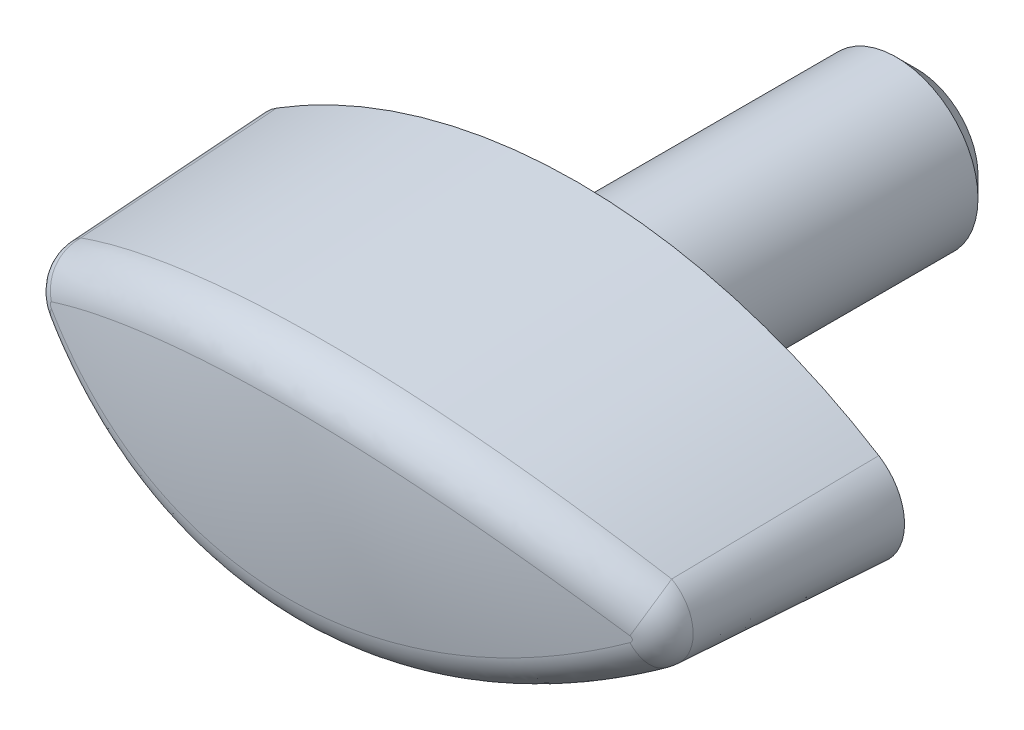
ISO-10303-21;
HEADER;
FILE_DESCRIPTION(('STEP AP214'),'2;1');
FILE_NAME('part.step','',(''),(''),'','','');
FILE_SCHEMA(('AUTOMOTIVE_DESIGN { 1 0 10303 214 1 1 1 1 }'));
ENDSEC;
DATA;
#1=APPLICATION_CONTEXT('core data for automotive mechanical design processes');
#2=APPLICATION_PROTOCOL_DEFINITION('international standard','automotive_design',2000,#1);
#3=PRODUCT_CONTEXT('',#1,'mechanical');
#4=PRODUCT('Part','Part','',(#3));
#5=PRODUCT_RELATED_PRODUCT_CATEGORY('part','',(#4));
#6=PRODUCT_DEFINITION_FORMATION('','',#4);
#7=PRODUCT_DEFINITION_CONTEXT('part definition',#1,'design');
#8=PRODUCT_DEFINITION('design','',#6,#7);
#9=PRODUCT_DEFINITION_SHAPE('','',#8);
#10=(LENGTH_UNIT() NAMED_UNIT(*) SI_UNIT(.MILLI.,.METRE.));
#11=(NAMED_UNIT(*) PLANE_ANGLE_UNIT() SI_UNIT($,.RADIAN.));
#12=(NAMED_UNIT(*) SI_UNIT($,.STERADIAN.) SOLID_ANGLE_UNIT());
#13=UNCERTAINTY_MEASURE_WITH_UNIT(LENGTH_MEASURE(1.E-05),#10,'distance_accuracy_value','');
#14=(GEOMETRIC_REPRESENTATION_CONTEXT(3) GLOBAL_UNCERTAINTY_ASSIGNED_CONTEXT((#13)) GLOBAL_UNIT_ASSIGNED_CONTEXT((#10,
#11,#12)) REPRESENTATION_CONTEXT('',''));
#15=CARTESIAN_POINT('',(0.,0.,0.));
#16=DIRECTION('',(0.,0.,1.));
#17=DIRECTION('',(1.,0.,0.));
#18=AXIS2_PLACEMENT_3D('',#15,#16,#17);
#19=CARTESIAN_POINT('',(0.,0.,0.));
#20=DIRECTION('',(0.,0.,1.));
#21=DIRECTION('',(1.,0.,0.));
#22=AXIS2_PLACEMENT_3D('',#19,#20,#21);
#23=PLANE('',#22);
#24=CARTESIAN_POINT('',(0.,0.,0.));
#25=DIRECTION('',(0.,0.,1.));
#26=DIRECTION('',(1.,0.,0.));
#27=AXIS2_PLACEMENT_3D('',#24,#25,#26);
#28=CIRCLE('',#27,5.);
#29=CARTESIAN_POINT('',(5.,0.,0.));
#30=VERTEX_POINT('',#29);
#31=EDGE_CURVE('E73',#30,#30,#28,.T.);
#32=ORIENTED_EDGE('',*,*,#31,.F.);
#33=EDGE_LOOP('',(#32));
#34=FACE_BOUND('',#33,.T.);
#35=CARTESIAN_POINT('',(0.,0.,0.));
#36=DIRECTION('',(0.,0.,1.));
#37=DIRECTION('',(1.,0.,0.));
#38=AXIS2_PLACEMENT_3D('',#35,#36,#37);
#39=CIRCLE('',#38,4.);
#40=CARTESIAN_POINT('',(4.,0.,0.));
#41=VERTEX_POINT('',#40);
#42=EDGE_CURVE('E244',#41,#41,#39,.F.);
#43=ORIENTED_EDGE('',*,*,#42,.F.);
#44=EDGE_LOOP('',(#43));
#45=FACE_BOUND('',#44,.T.);
#46=ADVANCED_FACE('F14',(#34,#45),#23,.F.);
#47=CARTESIAN_POINT('',(13.3241500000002,0.,0.6));
#48=DIRECTION('',(0.,0.,-1.));
#49=DIRECTION('',(1.,0.,0.));
#50=AXIS2_PLACEMENT_3D('',#47,#48,#49);
#51=CONICAL_SURFACE('',#50,2.67585,0.05235987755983);
#52=DIRECTION('',(0.0277113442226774,0.0443974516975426,-0.998629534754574));
#53=VECTOR('',#52,1.);
#54=CARTESIAN_POINT('',(14.740984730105,2.26996752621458,0.6));
#55=LINE('',#54,#53);
#56=CARTESIAN_POINT('',(14.4672021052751,1.83132944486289,10.4662631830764));
#57=VERTEX_POINT('',#56);
#58=CARTESIAN_POINT('',(14.740984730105,2.26996752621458,0.6));
#59=VERTEX_POINT('',#58);
#60=EDGE_CURVE('E67',#57,#59,#55,.T.);
#61=ORIENTED_EDGE('',*,*,#60,.F.);
#62=CARTESIAN_POINT('',(14.1108098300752,0.166021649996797,12.2354945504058));
#63=CARTESIAN_POINT('',(14.3791069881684,1.89963543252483,12.1178779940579));
#64=CARTESIAN_POINT('',(13.7556046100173,2.11406366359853,10.488000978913));
#65=CARTESIAN_POINT('',(14.1206757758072,0.164229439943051,12.2314837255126));
#66=CARTESIAN_POINT('',(14.4709389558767,1.84375069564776,12.0807327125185));
#67=CARTESIAN_POINT('',(13.8807542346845,2.08880404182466,10.4842046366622));
#68=CARTESIAN_POINT('',(14.1304087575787,0.161539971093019,12.2275262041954));
#69=CARTESIAN_POINT('',(14.5573909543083,1.78120267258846,12.0457616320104));
#70=CARTESIAN_POINT('',(14.0037556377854,2.05225919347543,10.4804587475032));
#71=CARTESIAN_POINT('',(14.149331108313,0.154432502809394,12.2198309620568));
#72=CARTESIAN_POINT('',(14.7174367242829,1.64606885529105,11.9810176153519));
#73=CARTESIAN_POINT('',(14.2421335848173,1.9576660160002,10.4731750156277));
#74=CARTESIAN_POINT('',(14.1585196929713,0.150012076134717,12.2160935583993));
#75=CARTESIAN_POINT('',(14.7913628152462,1.57353154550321,11.9511102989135));
#76=CARTESIAN_POINT('',(14.3574991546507,1.8995874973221,10.4696374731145));
#77=CARTESIAN_POINT('',(14.1753172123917,0.139950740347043,12.20926024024));
#78=CARTESIAN_POINT('',(14.9209668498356,1.42684806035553,11.8986754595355));
#79=CARTESIAN_POINT('',(14.5677797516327,1.76874922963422,10.4631695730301));
#80=CARTESIAN_POINT('',(14.1829939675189,0.134441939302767,12.2061368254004));
#81=CARTESIAN_POINT('',(14.9778340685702,1.3534010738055,11.8756670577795));
#82=CARTESIAN_POINT('',(14.663597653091,1.69761255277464,10.460213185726));
#83=CARTESIAN_POINT('',(14.1973956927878,0.12213486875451,12.2002765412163));
#84=CARTESIAN_POINT('',(15.0810613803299,1.20116793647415,11.8338996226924));
#85=CARTESIAN_POINT('',(14.8429330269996,1.53964661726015,10.4546662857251));
#86=CARTESIAN_POINT('',(14.2041215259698,0.115337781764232,12.1975393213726));
#87=CARTESIAN_POINT('',(15.1276484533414,1.12231233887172,11.815048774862));
#88=CARTESIAN_POINT('',(14.9264616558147,1.45283175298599,10.4520754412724));
#89=CARTESIAN_POINT('',(14.2164165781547,0.100570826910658,12.1925350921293));
#90=CARTESIAN_POINT('',(15.2105709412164,0.960026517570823,11.7814940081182));
#91=CARTESIAN_POINT('',(15.0788595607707,1.26502385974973,10.4473388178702));
#92=CARTESIAN_POINT('',(14.2219817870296,0.0925970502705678,12.1902697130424));
#93=CARTESIAN_POINT('',(15.2470602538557,0.876453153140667,11.7667278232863));
#94=CARTESIAN_POINT('',(15.1476780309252,1.16398362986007,10.445194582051));
#95=CARTESIAN_POINT('',(14.2317036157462,0.07569974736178,12.1863120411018));
#96=CARTESIAN_POINT('',(15.3095362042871,0.706031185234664,11.7414448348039));
#97=CARTESIAN_POINT('',(15.2677226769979,0.950505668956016,10.4414485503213));
#98=CARTESIAN_POINT('',(14.2358602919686,0.066776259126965,12.1846197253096));
#99=CARTESIAN_POINT('',(15.3356733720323,0.619012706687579,11.7308671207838));
#100=CARTESIAN_POINT('',(15.3189495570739,0.838068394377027,10.4398467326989));
#101=CARTESIAN_POINT('',(14.2423821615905,0.0487906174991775,12.1819643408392));
#102=CARTESIAN_POINT('',(15.3761517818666,0.447923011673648,11.7144851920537));
#103=CARTESIAN_POINT('',(15.3992531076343,0.611876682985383,10.4373333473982));
#104=CARTESIAN_POINT('',(14.2448371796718,0.0397664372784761,12.1809647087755));
#105=CARTESIAN_POINT('',(15.3911740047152,0.363819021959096,11.7084054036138));
#106=CARTESIAN_POINT('',(15.4294409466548,0.498575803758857,10.4363871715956));
#107=CARTESIAN_POINT('',(14.2482229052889,0.0213918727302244,12.1795860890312));
#108=CARTESIAN_POINT('',(15.4117646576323,0.194703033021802,11.7000719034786));
#109=CARTESIAN_POINT('',(15.4710596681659,0.268088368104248,10.4350822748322));
#110=CARTESIAN_POINT('',(14.2491542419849,0.0120416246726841,12.1792068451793));
#111=CARTESIAN_POINT('',(15.4173844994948,0.109500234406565,11.6977973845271));
#112=CARTESIAN_POINT('',(15.4824982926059,0.150903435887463,10.4347233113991));
#113=CARTESIAN_POINT('',(14.2494441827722,-0.00620208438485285,12.1790887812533));
#114=CARTESIAN_POINT('',(15.4191340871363,-0.0563876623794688,11.6970892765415));
#115=CARTESIAN_POINT('',(15.4860599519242,-0.0777237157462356,10.4346115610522));
#116=CARTESIAN_POINT('',(14.2488815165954,-0.0150942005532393,12.1793179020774));
#117=CARTESIAN_POINT('',(15.4157428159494,-0.137252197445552,11.6984618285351));
#118=CARTESIAN_POINT('',(15.4791499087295,-0.189150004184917,10.4348284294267));
#119=CARTESIAN_POINT('',(14.2463728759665,-0.0326463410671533,12.1803393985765));
#120=CARTESIAN_POINT('',(15.4005322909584,-0.298022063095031,11.7046179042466));
#121=CARTESIAN_POINT('',(15.4483205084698,-0.409237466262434,10.4357953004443));
#122=CARTESIAN_POINT('',(14.2444270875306,-0.0413063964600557,12.1811316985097));
#123=CARTESIAN_POINT('',(15.3886824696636,-0.378093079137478,11.7094137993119));
#124=CARTESIAN_POINT('',(15.4244034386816,-0.517899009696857,10.4365452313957));
#125=CARTESIAN_POINT('',(14.2392436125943,-0.05811181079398,12.1832422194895));
#126=CARTESIAN_POINT('',(15.3567481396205,-0.536043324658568,11.7223380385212));
#127=CARTESIAN_POINT('',(15.3606175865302,-0.729051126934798,10.4385428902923));
#128=CARTESIAN_POINT('',(14.2360125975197,-0.0662595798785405,12.1845577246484));
#129=CARTESIAN_POINT('',(15.3366416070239,-0.614083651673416,11.7304752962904));
#130=CARTESIAN_POINT('',(15.3208311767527,-0.831570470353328,10.4397880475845));
#131=CARTESIAN_POINT('',(14.2283768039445,-0.0818874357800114,12.1876663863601));
#132=CARTESIAN_POINT('',(15.2883129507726,-0.767675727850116,11.7500336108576));
#133=CARTESIAN_POINT('',(15.226660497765,-1.02861357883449,10.442730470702));
#134=CARTESIAN_POINT('',(14.2239716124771,-0.0893672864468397,12.1894597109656));
#135=CARTESIAN_POINT('',(15.2599944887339,-0.843356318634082,11.7614936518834));
#136=CARTESIAN_POINT('',(15.1722710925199,-1.12313451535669,10.4444278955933));
#137=CARTESIAN_POINT('',(14.2139302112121,-0.103786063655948,12.1935471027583));
#138=CARTESIAN_POINT('',(15.1939882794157,-0.994616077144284,11.7882042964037));
#139=CARTESIAN_POINT('',(15.0480588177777,-1.30585339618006,10.4482967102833));
#140=CARTESIAN_POINT('',(14.2082503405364,-0.110689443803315,12.1958589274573));
#141=CARTESIAN_POINT('',(15.155838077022,-1.07014975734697,11.8036419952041));
#142=CARTESIAN_POINT('',(14.9776871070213,-1.39362351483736,10.4504849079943));
#143=CARTESIAN_POINT('',(14.1959655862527,-0.123440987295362,12.2008584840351));
#144=CARTESIAN_POINT('',(15.0709364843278,-1.2168712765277,11.8379963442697));
#145=CARTESIAN_POINT('',(14.8251308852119,-1.55637651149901,10.4552171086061));
#146=CARTESIAN_POINT('',(14.1893618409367,-0.129290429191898,12.203545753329));
#147=CARTESIAN_POINT('',(15.024034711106,-1.2881490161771,11.8569738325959));
#148=CARTESIAN_POINT('',(14.7429609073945,-1.63137487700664,10.4577606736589));
#149=CARTESIAN_POINT('',(14.1776162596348,-0.13817907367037,12.2083247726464));
#150=CARTESIAN_POINT('',(14.9379254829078,-1.40369864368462,11.8918138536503));
#151=CARTESIAN_POINT('',(14.5964379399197,-1.74592665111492,10.4622841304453));
#152=CARTESIAN_POINT('',(14.1726684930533,-0.141523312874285,12.2103377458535));
#153=CARTESIAN_POINT('',(14.9007627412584,-1.4495731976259,11.9068495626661));
#154=CARTESIAN_POINT('',(14.5346172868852,-1.78920650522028,10.4641894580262));
#155=CARTESIAN_POINT('',(14.1588637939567,-0.149828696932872,12.2159535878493));
#156=CARTESIAN_POINT('',(14.7940855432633,-1.57068387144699,11.9500087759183));
#157=CARTESIAN_POINT('',(14.3618137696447,-1.89719077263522,10.469504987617));
#158=CARTESIAN_POINT('',(14.1497242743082,-0.154253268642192,12.2196710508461));
#159=CARTESIAN_POINT('',(14.7206446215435,-1.64302902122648,11.9797198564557));
#160=CARTESIAN_POINT('',(14.2470740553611,-1.95530528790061,10.4730236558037));
#161=CARTESIAN_POINT('',(14.1308196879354,-0.16141615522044,12.2273591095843));
#162=CARTESIAN_POINT('',(14.5609853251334,-1.77849193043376,12.0443076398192));
#163=CARTESIAN_POINT('',(14.0089448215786,-2.05058717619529,10.4803005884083));
#164=CARTESIAN_POINT('',(14.1210506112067,-0.164142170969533,12.2313313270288));
#165=CARTESIAN_POINT('',(14.4743389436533,-1.84146859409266,12.0793574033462));
#166=CARTESIAN_POINT('',(13.8854992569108,-2.08760160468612,10.4840603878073));
#167=CARTESIAN_POINT('',(14.111152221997,-0.16595885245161,12.2353553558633));
#168=CARTESIAN_POINT('',(14.3823216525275,-1.89767545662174,12.1165776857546));
#169=CARTESIAN_POINT('',(13.7599471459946,-2.11317980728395,10.4878692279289));
#170=(BOUNDED_SURFACE() B_SPLINE_SURFACE(3,2,((#62,#63,#64),(#65,#66,#67),(#68,#69,#70),(#71,
#72,#73),(#74,#75,#76),(#77,#78,#79),(#80,#81,#82),(#83,#84,#85),(#86,#87,#88),(#89,#90,#91),
(#92,#93,#94),(#95,#96,#97),(#98,#99,#100),(#101,#102,#103),(#104,#105,#106),(#107,#108,#109),
(#110,#111,#112),(#113,#114,#115),(#116,#117,#118),(#119,#120,#121),(#122,#123,#124),(#125,#126,
#127),(#128,#129,#130),(#131,#132,#133),(#134,#135,#136),(#137,#138,#139),(#140,#141,#142),
(#143,#144,#145),(#146,#147,#148),(#149,#150,#151),(#152,#153,#154),(#155,#156,#157),(#158,#159,
#160),(#161,#162,#163),(#164,#165,#166),(#167,#168,#169)),.UNSPECIFIED.,.F.,.F.,
.F.) B_SPLINE_SURFACE_WITH_KNOTS((4,2,2,2,2,2,2,2,2,2,2,2,2,2,2,2,2,4),(3,3),(0.,
0.0306443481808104,0.0613318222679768,0.0894666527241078,0.117575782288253,0.145780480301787,
0.173984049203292,0.200553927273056,0.227112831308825,0.252300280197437,0.27748434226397,
0.30253934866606,0.327603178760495,0.353711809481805,0.379788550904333,0.39765775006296,
0.428206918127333,0.458974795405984),(0.,1.),
.UNSPECIFIED.) GEOMETRIC_REPRESENTATION_ITEM() RATIONAL_B_SPLINE_SURFACE(((1.,0.751050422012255,
1.),(1.,0.758307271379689,1.),(1.,0.765328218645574,1.),(1.,0.778762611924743,1.),(1.,
0.785175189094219,1.),(1.,0.79673428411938,1.),(1.,0.801941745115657,1.),(1.,0.811605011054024,
1.),(1.,0.816061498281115,1.),(1.,0.824136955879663,1.),(1.,0.827753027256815,1.),(1.,
0.834029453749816,1.),(1.,0.836689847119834,1.),(1.,0.8408477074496,1.),(1.,0.842403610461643,
1.),(1.,0.844546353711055,1.),(1.,0.845133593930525,1.),(1.,0.845316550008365,1.),(1.,
0.844961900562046,1.),(1.,0.843376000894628,1.),(1.,0.842144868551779,1.),(1.,0.838848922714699,
1.),(1.,0.836788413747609,1.),(1.,0.831885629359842,1.),(1.,0.829043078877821,1.),(1.,
0.822508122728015,1.),(1.,0.818785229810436,1.),(1.,0.810646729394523,1.),(1.,0.806231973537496,
1.),(1.,0.798283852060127,1.),(1.,0.79491041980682,1.),(1.,0.785413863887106,1.),(1.,
0.779038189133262,1.),(1.,0.765623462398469,1.),(1.,0.758579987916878,1.),(1.,0.75130211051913,1.))) REPRESENTATION_ITEM('') SURFACE());
#171=CARTESIAN_POINT('',(13.7556046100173,2.11406366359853,10.488000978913));
#172=CARTESIAN_POINT('',(13.8807542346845,2.08880404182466,10.4842046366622));
#173=CARTESIAN_POINT('',(14.0037556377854,2.05225919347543,10.4804587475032));
#174=CARTESIAN_POINT('',(14.2421335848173,1.9576660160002,10.4731750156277));
#175=CARTESIAN_POINT('',(14.3574991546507,1.8995874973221,10.4696374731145));
#176=CARTESIAN_POINT('',(14.5677797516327,1.76874922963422,10.4631695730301));
#177=CARTESIAN_POINT('',(14.663597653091,1.69761255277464,10.460213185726));
#178=CARTESIAN_POINT('',(14.8429330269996,1.53964661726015,10.4546662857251));
#179=CARTESIAN_POINT('',(14.9264616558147,1.45283175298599,10.4520754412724));
#180=CARTESIAN_POINT('',(15.0788595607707,1.26502385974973,10.4473388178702));
#181=CARTESIAN_POINT('',(15.1476780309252,1.16398362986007,10.445194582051));
#182=CARTESIAN_POINT('',(15.2677226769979,0.950505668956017,10.4414485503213));
#183=CARTESIAN_POINT('',(15.3189495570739,0.838068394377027,10.4398467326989));
#184=CARTESIAN_POINT('',(15.3992531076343,0.611876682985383,10.4373333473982));
#185=CARTESIAN_POINT('',(15.4294409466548,0.498575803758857,10.4363871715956));
#186=CARTESIAN_POINT('',(15.4710596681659,0.268088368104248,10.4350822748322));
#187=CARTESIAN_POINT('',(15.4824982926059,0.150903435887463,10.4347233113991));
#188=CARTESIAN_POINT('',(15.4860599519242,-0.0777237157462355,10.4346115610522));
#189=CARTESIAN_POINT('',(15.4791499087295,-0.189150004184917,10.4348284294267));
#190=CARTESIAN_POINT('',(15.4483205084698,-0.409237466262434,10.4357953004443));
#191=CARTESIAN_POINT('',(15.4244034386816,-0.517899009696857,10.4365452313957));
#192=CARTESIAN_POINT('',(15.3606175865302,-0.729051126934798,10.4385428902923));
#193=CARTESIAN_POINT('',(15.3208311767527,-0.831570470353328,10.4397880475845));
#194=CARTESIAN_POINT('',(15.226660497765,-1.02861357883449,10.442730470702));
#195=CARTESIAN_POINT('',(15.1722710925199,-1.12313451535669,10.4444278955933));
#196=CARTESIAN_POINT('',(15.0480588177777,-1.30585339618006,10.4482967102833));
#197=CARTESIAN_POINT('',(14.9776871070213,-1.39362351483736,10.4504849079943));
#198=CARTESIAN_POINT('',(14.8251308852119,-1.55637651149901,10.4552171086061));
#199=CARTESIAN_POINT('',(14.7429609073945,-1.63137487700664,10.4577606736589));
#200=CARTESIAN_POINT('',(14.5964379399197,-1.74592665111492,10.4622841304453));
#201=CARTESIAN_POINT('',(14.5346172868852,-1.78920650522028,10.4641894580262));
#202=CARTESIAN_POINT('',(14.3618137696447,-1.89719077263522,10.469504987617));
#203=CARTESIAN_POINT('',(14.2470740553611,-1.95530528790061,10.4730236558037));
#204=CARTESIAN_POINT('',(14.0089448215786,-2.05058717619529,10.4803005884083));
#205=CARTESIAN_POINT('',(13.8854992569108,-2.08760160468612,10.4840603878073));
#206=CARTESIAN_POINT('',(13.7599471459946,-2.11317980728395,10.4878692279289));
#207=B_SPLINE_CURVE_WITH_KNOTS('',3,(#171,#172,#173,#174,#175,#176,#177,#178,#179,#180,#181,
#182,#183,#184,#185,#186,#187,#188,#189,#190,#191,#192,#193,#194,#195,#196,#197,#198,#199,#200,
#201,#202,#203,#204,#205,#206),.UNSPECIFIED.,.F.,.F.,(4,2,2,2,2,2,2,2,2,2,2,2,2,2,2,2,2,4),(0.,
0.0306443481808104,0.0613318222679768,0.0894666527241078,0.117575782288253,0.145780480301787,
0.173984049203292,0.200553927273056,0.227112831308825,0.252300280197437,0.27748434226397,
0.30253934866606,0.327603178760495,0.353711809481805,0.379788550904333,0.39765775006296,
0.428206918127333,0.458974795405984),.UNSPECIFIED.);
#208=CARTESIAN_POINT('',(14.4708427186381,-1.82905899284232,10.4661511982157));
#209=VERTEX_POINT('',#208);
#210=EDGE_CURVE('E37',#57,#209,#207,.T.);
#211=ORIENTED_EDGE('',*,*,#210,.T.);
#212=DIRECTION('',(0.02779952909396,-0.0443422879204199,-0.998629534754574));
#213=VECTOR('',#212,1.);
#214=CARTESIAN_POINT('',(14.7454934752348,-2.26714709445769,0.6));
#215=LINE('',#214,#213);
#216=CARTESIAN_POINT('',(14.7454934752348,-2.2671470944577,0.6));
#217=VERTEX_POINT('',#216);
#218=EDGE_CURVE('E86',#209,#217,#215,.T.);
#219=ORIENTED_EDGE('',*,*,#218,.T.);
#220=CARTESIAN_POINT('',(13.3241500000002,0.,0.6));
#221=DIRECTION('',(0.,0.,1.));
#222=DIRECTION('',(1.,0.,0.));
#223=AXIS2_PLACEMENT_3D('',#220,#221,#222);
#224=CIRCLE('',#223,2.67585);
#225=EDGE_CURVE('E81',#217,#59,#224,.T.);
#226=ORIENTED_EDGE('',*,*,#225,.T.);
#227=EDGE_LOOP('',(#61,#211,#219,#226));
#228=FACE_BOUND('',#227,.T.);
#229=ADVANCED_FACE('F85',(#228),#51,.T.);
#230=CARTESIAN_POINT('',(0.,-21.3471530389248,0.6));
#231=DIRECTION('',(0.,0.,-1.));
#232=DIRECTION('',(-1.,0.,0.));
#233=AXIS2_PLACEMENT_3D('',#230,#231,#232);
#234=CONICAL_SURFACE('',#233,27.8399894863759,0.05235987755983);
#235=DIRECTION('',(-0.0277113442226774,0.0443974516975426,-0.998629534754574));
#236=VECTOR('',#235,1.);
#237=CARTESIAN_POINT('',(-14.740984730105,2.26996752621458,0.6));
#238=LINE('',#237,#236);
#239=CARTESIAN_POINT('',(-14.4672021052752,1.83132944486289,10.4662631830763));
#240=VERTEX_POINT('',#239);
#241=CARTESIAN_POINT('',(-14.740984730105,2.26996752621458,0.6));
#242=VERTEX_POINT('',#241);
#243=EDGE_CURVE('E74',#240,#242,#238,.T.);
#244=ORIENTED_EDGE('',*,*,#243,.F.);
#245=CARTESIAN_POINT('',(-20.930406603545,-5.54084379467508,8.09552638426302));
#246=CARTESIAN_POINT('',(-21.7410431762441,-4.547930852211,7.71955722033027));
#247=CARTESIAN_POINT('',(-21.361002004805,-3.98479936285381,6.56942148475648));
#248=CARTESIAN_POINT('',(-20.7004619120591,-5.27506526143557,8.30163695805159));
#249=CARTESIAN_POINT('',(-21.5106243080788,-4.267807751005,7.92859864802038));
#250=CARTESIAN_POINT('',(-21.1269474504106,-3.71304857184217,6.76451010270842));
#251=CARTESIAN_POINT('',(-20.4639828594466,-5.01179059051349,8.50361247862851));
#252=CARTESIAN_POINT('',(-21.2736472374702,-3.99057334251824,8.13321259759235));
#253=CARTESIAN_POINT('',(-20.8861918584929,-3.44383895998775,6.95568479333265));
#254=CARTESIAN_POINT('',(-19.9779223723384,-4.49104867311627,8.89918767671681));
#255=CARTESIAN_POINT('',(-20.7855257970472,-3.44141472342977,8.53446912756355));
#256=CARTESIAN_POINT('',(-20.3912429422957,-2.91132293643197,7.33010623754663));
#257=CARTESIAN_POINT('',(-19.7283396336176,-4.23358200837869,9.09278651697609));
#258=CARTESIAN_POINT('',(-20.5343330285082,-3.16953159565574,8.73106329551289));
#259=CARTESIAN_POINT('',(-20.1370482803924,-2.648017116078,7.51335219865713));
#260=CARTESIAN_POINT('',(-18.9595965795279,-3.47081594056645,9.66106473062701));
#261=CARTESIAN_POINT('',(-19.7573480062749,-2.36110754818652,9.31014355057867));
#262=CARTESIAN_POINT('',(-19.3539579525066,-1.86790264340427,8.05124120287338));
#263=CARTESIAN_POINT('',(-18.4207642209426,-2.97552593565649,10.0229360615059));
#264=CARTESIAN_POINT('',(-19.2115942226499,-1.83598658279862,9.67881599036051));
#265=CARTESIAN_POINT('',(-18.8048845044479,-1.36128089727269,8.39376112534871));
#266=CARTESIAN_POINT('',(-17.2908790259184,-2.01786439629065,10.7116700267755));
#267=CARTESIAN_POINT('',(-18.0626793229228,-0.81734006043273,10.3825698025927));
#268=CARTESIAN_POINT('',(-17.6531688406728,-0.381598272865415,9.04566439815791));
#269=CARTESIAN_POINT('',(-16.6996961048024,-1.55558032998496,11.0384407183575));
#270=CARTESIAN_POINT('',(-17.4591825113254,-0.324431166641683,10.7170947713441));
#271=CARTESIAN_POINT('',(-17.0503931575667,0.0913734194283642,9.35496072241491));
#272=CARTESIAN_POINT('',(-15.4688973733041,-0.672564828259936,11.6542030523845));
#273=CARTESIAN_POINT('',(-16.1979631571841,0.620232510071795,11.3493931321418));
#274=CARTESIAN_POINT('',(-15.7951373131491,0.994894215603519,9.93779458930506));
#275=CARTESIAN_POINT('',(-14.8293034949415,-0.251814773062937,11.9432116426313));
#276=CARTESIAN_POINT('',(-15.5402244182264,1.0713800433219,11.6466903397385));
#277=CARTESIAN_POINT('',(-15.1426796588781,1.42546232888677,10.2113481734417));
#278=CARTESIAN_POINT('',(-13.6124946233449,0.477104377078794,12.4382223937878));
#279=CARTESIAN_POINT('',(-14.2850820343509,1.85512119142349,12.1571613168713));
#280=CARTESIAN_POINT('',(-13.901136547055,2.17145532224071,10.6798877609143));
#281=CARTESIAN_POINT('',(-13.0419564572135,0.792469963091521,12.6500870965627));
#282=CARTESIAN_POINT('',(-13.6946450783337,2.19501685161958,12.3760860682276));
#283=CARTESIAN_POINT('',(-13.3189045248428,2.49423413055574,10.880422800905));
#284=CARTESIAN_POINT('',(-11.8721076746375,1.3854487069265,13.045204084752));
#285=CARTESIAN_POINT('',(-12.4805399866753,2.83582708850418,12.7853667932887));
#286=CARTESIAN_POINT('',(-12.1249028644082,3.10119046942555,11.2544105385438));
#287=CARTESIAN_POINT('',(-11.2728009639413,1.66306696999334,13.2284602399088));
#288=CARTESIAN_POINT('',(-11.8570881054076,3.13631705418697,12.9754314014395));
#289=CARTESIAN_POINT('',(-11.5131372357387,3.38537322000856,11.4278668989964));
#290=CARTESIAN_POINT('',(-10.0497544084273,2.17658965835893,13.5651544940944));
#291=CARTESIAN_POINT('',(-10.5814304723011,3.69355654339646,13.3254494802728));
#292=CARTESIAN_POINT('',(-10.2645139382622,3.9110665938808,11.7465561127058));
#293=CARTESIAN_POINT('',(-9.42605842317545,2.41256510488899,13.718643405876));
#294=CARTESIAN_POINT('',(-9.92960151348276,3.9499601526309,13.4851771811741));
#295=CARTESIAN_POINT('',(-9.62770130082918,4.15264986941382,11.8918370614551));
#296=CARTESIAN_POINT('',(-8.15711575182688,2.84026101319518,13.9953538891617));
#297=CARTESIAN_POINT('',(-8.60031267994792,4.41576965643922,13.773759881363));
#298=CARTESIAN_POINT('',(-8.33194721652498,4.59052848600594,12.1537501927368));
#299=CARTESIAN_POINT('',(-7.51186909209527,3.03198152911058,14.1185754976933));
#300=CARTESIAN_POINT('',(-7.92330078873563,4.62478414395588,13.9023650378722));
#301=CARTESIAN_POINT('',(-7.67300579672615,4.78682388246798,12.2703824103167));
#302=CARTESIAN_POINT('',(-6.20206423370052,3.36907181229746,14.3343736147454));
#303=CARTESIAN_POINT('',(-6.54624797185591,4.99304862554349,14.1280313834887));
#304=CARTESIAN_POINT('',(-6.33530350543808,5.13196895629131,12.4746405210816));
#305=CARTESIAN_POINT('',(-5.53745046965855,3.51429011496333,14.4268500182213));
#306=CARTESIAN_POINT('',(-5.84670761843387,5.15179618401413,14.2247777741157));
#307=CARTESIAN_POINT('',(-5.65648557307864,5.28066359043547,12.5621716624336));
#308=CARTESIAN_POINT('',(-4.19571386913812,3.75546170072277,14.5800346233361));
#309=CARTESIAN_POINT('',(-4.4321676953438,5.41590302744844,14.3853044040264));
#310=CARTESIAN_POINT('',(-4.28600316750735,5.52761370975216,12.7071645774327));
#311=CARTESIAN_POINT('',(-3.51859089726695,3.8514144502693,14.6407424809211));
#312=CARTESIAN_POINT('',(-3.71782004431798,5.52100436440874,14.4489266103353));
#313=CARTESIAN_POINT('',(-3.59433855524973,5.62586864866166,12.7646260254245));
#314=CARTESIAN_POINT('',(-2.15653707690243,3.99270187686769,14.7300250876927));
#315=CARTESIAN_POINT('',(-2.27918661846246,5.67597876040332,14.5426217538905));
#316=CARTESIAN_POINT('',(-2.20299283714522,5.77054741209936,12.8491341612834));
#317=CARTESIAN_POINT('',(-1.47160152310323,4.03800422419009,14.7585793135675));
#318=CARTESIAN_POINT('',(-1.55561281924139,5.72565919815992,14.5725779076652));
#319=CARTESIAN_POINT('',(-1.50330689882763,5.81693813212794,12.8761614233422));
#320=CARTESIAN_POINT('',(-0.099695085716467,4.07721043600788,14.7832952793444));
#321=CARTESIAN_POINT('',(-0.105290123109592,5.76869686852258,14.5985331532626));
#322=CARTESIAN_POINT('',(-0.101844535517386,5.85708620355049,12.8995556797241));
#323=CARTESIAN_POINT('',(0.5872757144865,4.07111637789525,14.779458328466));
#324=CARTESIAN_POINT('',(0.62070953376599,5.76201188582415,14.5945067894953));
#325=CARTESIAN_POINT('',(0.5999318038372,5.8508456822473,12.8959239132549));
#326=CARTESIAN_POINT('',(1.93086467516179,4.0088809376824,14.7402116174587));
#327=CARTESIAN_POINT('',(2.04094432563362,5.69370033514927,14.5532952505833));
#328=CARTESIAN_POINT('',(1.97245978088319,5.78711531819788,12.8587759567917));
#329=CARTESIAN_POINT('',(2.58761241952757,3.95472063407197,14.7060516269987));
#330=CARTESIAN_POINT('',(2.73461323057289,5.63431387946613,14.5174620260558));
#331=CARTESIAN_POINT('',(2.6433445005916,5.73165413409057,12.8264427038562));
#332=CARTESIAN_POINT('',(3.89335170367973,3.79980545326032,14.6080794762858));
#333=CARTESIAN_POINT('',(4.11336288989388,5.46443501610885,14.4146710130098));
#334=CARTESIAN_POINT('',(3.97714814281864,5.57302153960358,12.7337097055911));
#335=CARTESIAN_POINT('',(4.54234318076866,3.69905019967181,14.5442670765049));
#336=CARTESIAN_POINT('',(4.79781680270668,5.35410028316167,14.3478089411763));
#337=CARTESIAN_POINT('',(4.64006700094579,5.46984974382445,12.6733097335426));
#338=CARTESIAN_POINT('',(5.82744950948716,3.45240071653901,14.3874367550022));
#339=CARTESIAN_POINT('',(6.15214016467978,5.08408369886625,14.183509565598));
#340=CARTESIAN_POINT('',(5.95268411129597,5.21729265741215,12.5248660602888));
#341=CARTESIAN_POINT('',(6.46357612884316,3.30654992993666,14.2944469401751));
#342=CARTESIAN_POINT('',(6.82145498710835,4.92469033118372,14.0862496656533));
#343=CARTESIAN_POINT('',(6.60239444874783,5.06795184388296,12.4368489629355));
#344=CARTESIAN_POINT('',(7.71921398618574,2.97165684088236,14.0798148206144));
#345=CARTESIAN_POINT('',(8.14103660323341,4.55894972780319,13.861868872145));
#346=CARTESIAN_POINT('',(7.88475364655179,4.72505955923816,12.2336944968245));
#347=CARTESIAN_POINT('',(8.3387274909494,2.78262046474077,13.9581764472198));
#348=CARTESIAN_POINT('',(8.79082047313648,4.35291539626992,13.7349435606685));
#349=CARTESIAN_POINT('',(8.51740483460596,4.53151415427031,12.1185608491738));
#350=CARTESIAN_POINT('',(9.87188364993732,2.25556965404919,13.6168535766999));
#351=CARTESIAN_POINT('',(10.3946908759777,3.7796641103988,13.3794408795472));
#352=CARTESIAN_POINT('',(10.0829301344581,3.99191937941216,11.7954905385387));
#353=CARTESIAN_POINT('',(10.7725226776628,1.89099127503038,13.378950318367));
#354=CARTESIAN_POINT('',(11.3344018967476,3.38422765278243,13.1322848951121));
#355=CARTESIAN_POINT('',(11.0024508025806,3.61868668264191,11.5703093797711));
#356=CARTESIAN_POINT('',(12.51579746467,1.07787551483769,12.8413283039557));
#357=CARTESIAN_POINT('',(13.1479104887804,2.50379946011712,12.5744407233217));
#358=CARTESIAN_POINT('',(12.781941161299,2.78635444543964,11.061437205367));
#359=CARTESIAN_POINT('',(13.3584048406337,0.629297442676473,12.541579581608));
#360=CARTESIAN_POINT('',(14.0208513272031,2.02009902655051,12.2646196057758));
#361=CARTESIAN_POINT('',(13.6418817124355,2.32721328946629,10.7777178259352));
#362=CARTESIAN_POINT('',(14.8280629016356,-0.251057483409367,11.9437238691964));
#363=CARTESIAN_POINT('',(15.5389439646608,1.07219108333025,11.647215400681));
#364=CARTESIAN_POINT('',(15.1414139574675,1.42623735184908,10.2118330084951));
#365=CARTESIAN_POINT('',(15.4663339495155,-0.670873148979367,11.6553645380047));
#366=CARTESIAN_POINT('',(16.1953342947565,0.622040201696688,11.3505835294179));
#367=CARTESIAN_POINT('',(15.79252236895,0.996625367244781,9.93889396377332));
#368=CARTESIAN_POINT('',(16.6949333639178,-1.55201673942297,11.0409438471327));
#369=CARTESIAN_POINT('',(17.454323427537,-0.320632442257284,10.7196566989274));
#370=CARTESIAN_POINT('',(17.0455363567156,0.0950195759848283,9.35732999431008));
#371=CARTESIAN_POINT('',(17.2852280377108,-2.01337336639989,10.7148563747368));
#372=CARTESIAN_POINT('',(18.0569246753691,-0.812560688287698,10.3858260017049));
#373=CARTESIAN_POINT('',(17.6474073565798,-0.377003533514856,9.0486803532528));
#374=CARTESIAN_POINT('',(18.4156488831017,-2.9708948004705,10.0263097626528));
#375=CARTESIAN_POINT('',(19.2063992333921,-1.83106388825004,9.68226181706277));
#376=CARTESIAN_POINT('',(18.7996716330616,-1.35654370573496,8.39695441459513));
#377=CARTESIAN_POINT('',(18.9557117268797,-3.46710219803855,9.66380587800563));
#378=CARTESIAN_POINT('',(19.7534125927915,-2.357165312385,9.31294056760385));
#379=CARTESIAN_POINT('',(19.349999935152,-1.86410419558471,8.05383576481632));
#380=CARTESIAN_POINT('',(19.7260881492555,-4.23127814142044,9.09451567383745));
#381=CARTESIAN_POINT('',(20.5320642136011,-3.16709587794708,8.73282122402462));
#382=CARTESIAN_POINT('',(20.1347551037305,-2.64566096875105,7.51498888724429));
#383=CARTESIAN_POINT('',(19.9761533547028,-4.48918945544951,8.90059285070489));
#384=CARTESIAN_POINT('',(20.7837454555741,-3.43945055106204,8.5358968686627));
#385=CARTESIAN_POINT('',(20.3894414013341,-2.90942161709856,7.33143626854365));
#386=CARTESIAN_POINT('',(20.4631333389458,-5.01084463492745,8.50433817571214));
#387=CARTESIAN_POINT('',(21.2727940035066,-3.98957500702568,8.13394940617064));
#388=CARTESIAN_POINT('',(20.8853269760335,-3.4428716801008,6.95637168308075));
#389=CARTESIAN_POINT('',(20.7000493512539,-5.2745879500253,8.30200711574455));
#390=CARTESIAN_POINT('',(21.5102098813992,-4.26730350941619,7.92897492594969));
#391=CARTESIAN_POINT('',(21.1265275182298,-3.71256053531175,6.76486046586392));
#392=CARTESIAN_POINT('',(20.9304066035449,-5.54084379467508,8.09552638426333));
#393=CARTESIAN_POINT('',(21.7410431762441,-4.547930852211,7.71955722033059));
#394=CARTESIAN_POINT('',(21.361002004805,-3.98479936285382,6.56942148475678));
#395=(BOUNDED_SURFACE() B_SPLINE_SURFACE(3,2,((#245,#246,#247),(#248,#249,#250),(#251,#252,
#253),(#254,#255,#256),(#257,#258,#259),(#260,#261,#262),(#263,#264,#265),(#266,#267,#268),
(#269,#270,#271),(#272,#273,#274),(#275,#276,#277),(#278,#279,#280),(#281,#282,#283),(#284,#285,
#286),(#287,#288,#289),(#290,#291,#292),(#293,#294,#295),(#296,#297,#298),(#299,#300,#301),
(#302,#303,#304),(#305,#306,#307),(#308,#309,#310),(#311,#312,#313),(#314,#315,#316),(#317,#318,
#319),(#320,#321,#322),(#323,#324,#325),(#326,#327,#328),(#329,#330,#331),(#332,#333,#334),
(#335,#336,#337),(#338,#339,#340),(#341,#342,#343),(#344,#345,#346),(#347,#348,#349),(#350,#351,
#352),(#353,#354,#355),(#356,#357,#358),(#359,#360,#361),(#362,#363,#364),(#365,#366,#367),
(#368,#369,#370),(#371,#372,#373),(#374,#375,#376),(#377,#378,#379),(#380,#381,#382),(#383,#384,
#385),(#386,#387,#388),(#389,#390,#391),(#392,#393,#394)),.UNSPECIFIED.,.F.,.F.,
.F.) B_SPLINE_SURFACE_WITH_KNOTS((4,2,2,2,2,2,2,2,2,2,2,2,2,2,2,2,2,2,2,2,2,2,2,2,4),(3,3),(0.,
1.15675494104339,2.31362523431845,4.62898987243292,6.95027863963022,9.27052199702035,
11.2149387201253,13.1590922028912,15.0998972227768,17.0406998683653,18.9877611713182,
20.9348435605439,22.8831680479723,24.8314137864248,26.7029081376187,28.5744176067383,
30.444129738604,32.3135854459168,35.1467321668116,37.9812548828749,40.2968026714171,
42.6139628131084,44.9340057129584,46.0929475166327,47.2517804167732),(0.,1.),
.UNSPECIFIED.) GEOMETRIC_REPRESENTATION_ITEM() RATIONAL_B_SPLINE_SURFACE(((1.,0.83157670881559,
1.),(1.,0.829747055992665,1.),(1.,0.827926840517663,1.),(1.,0.824311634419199,1.),(1.,
0.822516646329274,1.),(1.,0.817177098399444,1.),(1.,0.813680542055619,1.),(1.,0.806867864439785,
1.),(1.,0.803552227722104,1.),(1.,0.797173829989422,1.),(1.,0.794110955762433,1.),(1.,
0.788770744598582,1.),(1.,0.786446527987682,1.),(1.,0.782055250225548,1.),(1.,0.779988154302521,
1.),(1.,0.776148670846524,1.),(1.,0.774375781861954,1.),(1.,0.771151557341,1.),(1.,
0.769700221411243,1.),(1.,0.767141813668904,1.),(1.,0.766035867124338,1.),(1.,0.764195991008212,
1.),(1.,0.763462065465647,1.),(1.,0.762380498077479,1.),(1.,0.7620331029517,1.),(1.,
0.761732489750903,1.),(1.,0.761779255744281,1.),(1.,0.762256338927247,1.),(1.,0.762671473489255,
1.),(1.,0.763856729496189,1.),(1.,0.764626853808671,1.),(1.,0.766507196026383,1.),(1.,
0.76761708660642,1.),(1.,0.770156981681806,1.),(1.,0.771586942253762,1.),(1.,0.775557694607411,
1.),(1.,0.778291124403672,1.),(1.,0.784339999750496,1.),(1.,0.787655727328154,1.),(1.,
0.794105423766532,1.),(1.,0.797161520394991,1.),(1.,0.803526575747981,1.),(1.,0.806835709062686,
1.),(1.,0.813647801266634,1.),(1.,0.817150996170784,1.),(1.,0.82250057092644,1.),(1.,
0.824298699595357,1.),(1.,0.82792030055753,1.),(1.,0.829743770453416,1.),(1.,0.831576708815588,1.))) REPRESENTATION_ITEM('') SURFACE());
#396=CARTESIAN_POINT('',(-21.361002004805,-3.98479936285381,6.56942148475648));
#397=CARTESIAN_POINT('',(-21.1269474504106,-3.71304857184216,6.76451010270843));
#398=CARTESIAN_POINT('',(-20.8861918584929,-3.44383895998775,6.95568479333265));
#399=CARTESIAN_POINT('',(-20.3912429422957,-2.91132293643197,7.33010623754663));
#400=CARTESIAN_POINT('',(-20.1370482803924,-2.648017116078,7.51335219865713));
#401=CARTESIAN_POINT('',(-19.3539579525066,-1.86790264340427,8.05124120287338));
#402=CARTESIAN_POINT('',(-18.8048845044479,-1.36128089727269,8.39376112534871));
#403=CARTESIAN_POINT('',(-17.6531688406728,-0.381598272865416,9.04566439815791));
#404=CARTESIAN_POINT('',(-17.0503931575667,0.0913734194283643,9.35496072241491));
#405=CARTESIAN_POINT('',(-15.7951373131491,0.99489421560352,9.93779458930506));
#406=CARTESIAN_POINT('',(-15.1426796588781,1.42546232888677,10.2113481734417));
#407=CARTESIAN_POINT('',(-13.901136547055,2.17145532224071,10.6798877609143));
#408=CARTESIAN_POINT('',(-13.3189045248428,2.49423413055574,10.880422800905));
#409=CARTESIAN_POINT('',(-12.1249028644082,3.10119046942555,11.2544105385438));
#410=CARTESIAN_POINT('',(-11.5131372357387,3.38537322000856,11.4278668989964));
#411=CARTESIAN_POINT('',(-10.2645139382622,3.9110665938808,11.7465561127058));
#412=CARTESIAN_POINT('',(-9.62770130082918,4.15264986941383,11.8918370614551));
#413=CARTESIAN_POINT('',(-8.33194721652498,4.59052848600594,12.1537501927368));
#414=CARTESIAN_POINT('',(-7.67300579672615,4.78682388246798,12.2703824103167));
#415=CARTESIAN_POINT('',(-6.33530350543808,5.13196895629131,12.4746405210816));
#416=CARTESIAN_POINT('',(-5.65648557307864,5.28066359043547,12.5621716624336));
#417=CARTESIAN_POINT('',(-4.28600316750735,5.52761370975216,12.7071645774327));
#418=CARTESIAN_POINT('',(-3.59433855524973,5.62586864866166,12.7646260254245));
#419=CARTESIAN_POINT('',(-2.20299283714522,5.77054741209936,12.8491341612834));
#420=CARTESIAN_POINT('',(-1.50330689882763,5.81693813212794,12.8761614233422));
#421=CARTESIAN_POINT('',(-0.101844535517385,5.85708620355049,12.8995556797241));
#422=CARTESIAN_POINT('',(0.5999318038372,5.8508456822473,12.8959239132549));
#423=CARTESIAN_POINT('',(1.97245978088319,5.78711531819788,12.8587759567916));
#424=CARTESIAN_POINT('',(2.6433445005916,5.73165413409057,12.8264427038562));
#425=CARTESIAN_POINT('',(3.97714814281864,5.57302153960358,12.7337097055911));
#426=CARTESIAN_POINT('',(4.64006700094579,5.46984974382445,12.6733097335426));
#427=CARTESIAN_POINT('',(5.95268411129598,5.21729265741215,12.5248660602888));
#428=CARTESIAN_POINT('',(6.60239444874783,5.06795184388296,12.4368489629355));
#429=CARTESIAN_POINT('',(7.88475364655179,4.72505955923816,12.2336944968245));
#430=CARTESIAN_POINT('',(8.51740483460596,4.53151415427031,12.1185608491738));
#431=CARTESIAN_POINT('',(10.0829301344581,3.99191937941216,11.7954905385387));
#432=CARTESIAN_POINT('',(11.0024508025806,3.61868668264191,11.5703093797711));
#433=CARTESIAN_POINT('',(12.781941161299,2.78635444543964,11.061437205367));
#434=CARTESIAN_POINT('',(13.6418817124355,2.32721328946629,10.7777178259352));
#435=CARTESIAN_POINT('',(15.1414139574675,1.42623735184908,10.2118330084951));
#436=CARTESIAN_POINT('',(15.79252236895,0.996625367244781,9.93889396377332));
#437=CARTESIAN_POINT('',(17.0455363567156,0.0950195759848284,9.35732999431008));
#438=CARTESIAN_POINT('',(17.6474073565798,-0.377003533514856,9.0486803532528));
#439=CARTESIAN_POINT('',(18.7996716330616,-1.35654370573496,8.39695441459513));
#440=CARTESIAN_POINT('',(19.349999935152,-1.86410419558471,8.05383576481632));
#441=CARTESIAN_POINT('',(20.1347551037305,-2.64566096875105,7.51498888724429));
#442=CARTESIAN_POINT('',(20.3894414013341,-2.90942161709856,7.33143626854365));
#443=CARTESIAN_POINT('',(20.8853269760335,-3.4428716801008,6.95637168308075));
#444=CARTESIAN_POINT('',(21.1265275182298,-3.71256053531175,6.76486046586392));
#445=CARTESIAN_POINT('',(21.361002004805,-3.98479936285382,6.56942148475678));
#446=B_SPLINE_CURVE_WITH_KNOTS('',3,(#396,#397,#398,#399,#400,#401,#402,#403,#404,#405,#406,
#407,#408,#409,#410,#411,#412,#413,#414,#415,#416,#417,#418,#419,#420,#421,#422,#423,#424,#425,
#426,#427,#428,#429,#430,#431,#432,#433,#434,#435,#436,#437,#438,#439,#440,#441,#442,#443,#444,
#445),.UNSPECIFIED.,.F.,.F.,(4,2,2,2,2,2,2,2,2,2,2,2,2,2,2,2,2,2,2,2,2,2,2,2,4),(0.,
1.15675494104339,2.31362523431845,4.62898987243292,6.95027863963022,9.27052199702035,
11.2149387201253,13.1590922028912,15.0998972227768,17.0406998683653,18.9877611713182,
20.9348435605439,22.8831680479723,24.8314137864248,26.7029081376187,28.5744176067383,
30.444129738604,32.3135854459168,35.1467321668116,37.9812548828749,40.2968026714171,
42.6139628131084,44.9340057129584,46.0929475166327,47.2517804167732),.UNSPECIFIED.);
#447=EDGE_CURVE('E30',#240,#57,#446,.T.);
#448=ORIENTED_EDGE('',*,*,#447,.T.);
#449=ORIENTED_EDGE('',*,*,#60,.T.);
#450=CARTESIAN_POINT('',(0.,-21.3471530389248,0.6));
#451=DIRECTION('',(0.,0.,1.));
#452=DIRECTION('',(-1.,0.,0.));
#453=AXIS2_PLACEMENT_3D('',#450,#451,#452);
#454=CIRCLE('',#453,27.8399894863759);
#455=EDGE_CURVE('E70',#59,#242,#454,.T.);
#456=ORIENTED_EDGE('',*,*,#455,.T.);
#457=EDGE_LOOP('',(#244,#448,#449,#456));
#458=FACE_BOUND('',#457,.T.);
#459=ADVANCED_FACE('F69',(#458),#234,.T.);
#460=CARTESIAN_POINT('',(-13.3241500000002,0.,0.6));
#461=DIRECTION('',(0.,0.,-1.));
#462=DIRECTION('',(1.,0.,0.));
#463=AXIS2_PLACEMENT_3D('',#460,#461,#462);
#464=CONICAL_SURFACE('',#463,2.67585,0.05235987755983);
#465=DIRECTION('',(-0.02779952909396,-0.0443422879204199,-0.998629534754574));
#466=VECTOR('',#465,1.);
#467=CARTESIAN_POINT('',(-14.7454934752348,-2.2671470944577,0.6));
#468=LINE('',#467,#466);
#469=CARTESIAN_POINT('',(-14.470842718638,-1.82905899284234,10.4661511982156));
#470=VERTEX_POINT('',#469);
#471=CARTESIAN_POINT('',(-14.7454934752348,-2.26714709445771,0.6));
#472=VERTEX_POINT('',#471);
#473=EDGE_CURVE('E107',#470,#472,#468,.T.);
#474=ORIENTED_EDGE('',*,*,#473,.F.);
#475=CARTESIAN_POINT('',(-14.111152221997,-0.16595885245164,12.2353553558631));
#476=CARTESIAN_POINT('',(-14.3823216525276,-1.89767545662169,12.1165776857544));
#477=CARTESIAN_POINT('',(-13.7599471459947,-2.11317980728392,10.4878692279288));
#478=CARTESIAN_POINT('',(-14.1210125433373,-0.164146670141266,12.2313468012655));
#479=CARTESIAN_POINT('',(-14.4739846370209,-1.84166140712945,12.079500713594));
#480=CARTESIAN_POINT('',(-13.8850154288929,-2.08766924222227,10.4840750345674));
#481=CARTESIAN_POINT('',(-14.1307383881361,-0.161437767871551,12.2273921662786));
#482=CARTESIAN_POINT('',(-14.5602693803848,-1.77900246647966,12.0445972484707));
#483=CARTESIAN_POINT('',(-14.0079170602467,-2.05088202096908,10.4803318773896));
#484=CARTESIAN_POINT('',(-14.1496435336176,-0.154292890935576,12.219703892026));
#485=CARTESIAN_POINT('',(-14.7199907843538,-1.64367787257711,11.9799843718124));
#486=CARTESIAN_POINT('',(-14.2460605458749,-1.9558251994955,10.4730547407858));
#487=CARTESIAN_POINT('',(-14.1588220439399,-0.14985448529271,12.215970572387));
#488=CARTESIAN_POINT('',(-14.7937592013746,-1.57105955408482,11.950140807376));
#489=CARTESIAN_POINT('',(-14.3612913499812,-1.89752536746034,10.4695210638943));
#490=CARTESIAN_POINT('',(-14.1755957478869,-0.139761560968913,12.2091469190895));
#491=CARTESIAN_POINT('',(-14.9230565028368,-1.42425839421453,11.8978300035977));
#492=CARTESIAN_POINT('',(-14.5712596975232,-1.76630134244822,10.4630623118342));
#493=CARTESIAN_POINT('',(-14.1832591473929,-0.134239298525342,12.2060289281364));
#494=CARTESIAN_POINT('',(-14.9797757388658,-1.35077369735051,11.8748814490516));
#495=CARTESIAN_POINT('',(-14.6669048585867,-1.69500184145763,10.4601110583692));
#496=CARTESIAN_POINT('',(-14.1976322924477,-0.12190790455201,12.2001802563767));
#497=CARTESIAN_POINT('',(-15.082718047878,-1.1984835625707,11.8332292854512));
#498=CARTESIAN_POINT('',(-14.8458739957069,-1.53674349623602,10.4545751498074));
#499=CARTESIAN_POINT('',(-14.2043429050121,-0.115099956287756,12.1974492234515));
#500=CARTESIAN_POINT('',(-15.1291674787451,-1.11960817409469,11.8144341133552));
#501=CARTESIAN_POINT('',(-14.9292091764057,-1.4497990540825,10.4519901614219));
#502=CARTESIAN_POINT('',(-14.2166059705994,-0.100314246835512,12.1924580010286));
#503=CARTESIAN_POINT('',(-15.2118238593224,-0.95729843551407,11.7809869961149));
#504=CARTESIAN_POINT('',(-15.0812034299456,-1.26176895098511,10.4472658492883));
#505=CARTESIAN_POINT('',(-14.2221544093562,-0.0923325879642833,12.1901994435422));
#506=CARTESIAN_POINT('',(-15.2481840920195,-0.873720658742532,11.7662730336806));
#507=CARTESIAN_POINT('',(-15.149811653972,-1.16063622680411,10.4451280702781));
#508=CARTESIAN_POINT('',(-14.2318417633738,-0.0754229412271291,12.1862557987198));
#509=CARTESIAN_POINT('',(-15.3104108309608,-0.703304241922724,11.741090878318));
#510=CARTESIAN_POINT('',(-15.26942634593,-0.94701496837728,10.4413953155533));
#511=CARTESIAN_POINT('',(-14.2359807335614,-0.0664949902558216,12.1845706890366));
#512=CARTESIAN_POINT('',(-15.3364272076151,-0.616295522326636,11.730562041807));
#513=CARTESIAN_POINT('',(-15.3204334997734,-0.834526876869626,10.4398003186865));
#514=CARTESIAN_POINT('',(-14.2424682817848,-0.0485036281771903,12.1819292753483));
#515=CARTESIAN_POINT('',(-15.3766810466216,-0.445231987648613,11.7142709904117));
#516=CARTESIAN_POINT('',(-15.400312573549,-0.608271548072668,10.4373001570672));
#517=CARTESIAN_POINT('',(-14.2449065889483,-0.039477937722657,12.1809364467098));
#518=CARTESIAN_POINT('',(-15.3915978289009,-0.361143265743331,11.7082338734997));
#519=CARTESIAN_POINT('',(-15.4302943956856,-0.494954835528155,10.4363604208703));
#520=CARTESIAN_POINT('',(-14.2482592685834,-0.0211036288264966,12.1795712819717));
#521=CARTESIAN_POINT('',(-15.4119845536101,-0.19206902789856,11.6999829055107));
#522=CARTESIAN_POINT('',(-15.4715064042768,-0.264474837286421,10.4350682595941));
#523=CARTESIAN_POINT('',(-14.2491742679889,-0.0117551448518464,12.1791986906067));
#524=CARTESIAN_POINT('',(-15.4175053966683,-0.10689278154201,11.6977484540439));
#525=CARTESIAN_POINT('',(-15.4827443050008,-0.147313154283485,10.4347155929));
#526=CARTESIAN_POINT('',(-14.2494335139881,0.0064840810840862,12.1790931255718));
#527=CARTESIAN_POINT('',(-15.4190697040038,0.058951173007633,11.6971153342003));
#528=CARTESIAN_POINT('',(-15.485928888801,0.0812574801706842,10.4346156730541));
#529=CARTESIAN_POINT('',(-14.2488561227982,0.0153736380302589,12.1793282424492));
#530=CARTESIAN_POINT('',(-15.4155895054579,0.139798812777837,11.6985238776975));
#531=CARTESIAN_POINT('',(-15.4788379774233,0.192652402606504,10.4348382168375));
#532=CARTESIAN_POINT('',(-14.2463190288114,0.0329181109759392,12.1803613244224));
#533=CARTESIAN_POINT('',(-15.4002047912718,0.30052635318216,11.7047504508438));
#534=CARTESIAN_POINT('',(-15.4476586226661,0.412646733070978,10.435816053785));
#535=CARTESIAN_POINT('',(-14.2443595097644,0.041573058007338,12.1811592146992));
#536=CARTESIAN_POINT('',(-15.3882693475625,0.380571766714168,11.7095809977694));
#537=CARTESIAN_POINT('',(-15.4235724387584,0.521246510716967,10.4365712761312));
#538=CARTESIAN_POINT('',(-14.2391494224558,0.0583683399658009,12.1832805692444));
#539=CARTESIAN_POINT('',(-15.3561638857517,0.538484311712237,11.7225744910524));
#540=CARTESIAN_POINT('',(-15.359457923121,0.732277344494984,10.4385791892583));
#541=CARTESIAN_POINT('',(-14.2359051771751,0.0665109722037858,12.1846014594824));
#542=CARTESIAN_POINT('',(-15.3359693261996,0.616511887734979,11.7307473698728));
#543=CARTESIAN_POINT('',(-15.319507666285,0.834735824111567,10.4398294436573));
#544=CARTESIAN_POINT('',(-14.2282440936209,0.0821264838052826,12.1877204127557));
#545=CARTESIAN_POINT('',(-15.2874641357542,0.770070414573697,11.7503771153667));
#546=CARTESIAN_POINT('',(-15.2250224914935,1.0316320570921,10.4427816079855));
#547=CARTESIAN_POINT('',(-14.2238268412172,0.0895991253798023,12.1895186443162));
#548=CARTESIAN_POINT('',(-15.2590568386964,0.845729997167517,11.7618730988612));
#549=CARTESIAN_POINT('',(-15.1704824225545,1.12606696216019,10.4444836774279));
#550=CARTESIAN_POINT('',(-14.2137612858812,0.104002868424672,12.1936158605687));
#551=CARTESIAN_POINT('',(-15.1928617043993,0.996953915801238,11.7886601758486));
#552=CARTESIAN_POINT('',(-15.0459668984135,1.3086067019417,10.4483617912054));
#553=CARTESIAN_POINT('',(-14.2080691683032,0.110898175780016,12.1959326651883));
#554=CARTESIAN_POINT('',(-15.154609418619,1.07247135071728,11.8041391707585));
#555=CARTESIAN_POINT('',(-14.9754405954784,1.39628070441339,10.4505547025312));
#556=CARTESIAN_POINT('',(-14.1957613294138,0.123631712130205,12.2009416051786));
#557=CARTESIAN_POINT('',(-15.0694987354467,1.21914960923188,11.8385780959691));
#558=CARTESIAN_POINT('',(-14.8225909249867,1.55881794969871,10.4552957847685));
#559=CARTESIAN_POINT('',(-14.189146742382,0.12947121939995,12.2036332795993));
#560=CARTESIAN_POINT('',(-15.0224895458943,1.29040002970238,11.857599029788));
#561=CARTESIAN_POINT('',(-14.74028204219,1.63369667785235,10.45784351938));
#562=CARTESIAN_POINT('',(-14.1773697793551,0.138352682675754,12.2084250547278));
#563=CARTESIAN_POINT('',(-14.936088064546,1.40603579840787,11.8925572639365));
#564=CARTESIAN_POINT('',(-14.593359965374,1.74816987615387,10.4623790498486));
#565=CARTESIAN_POINT('',(-14.1724000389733,0.141698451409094,12.2104469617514));
#566=CARTESIAN_POINT('',(-14.8987295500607,1.45201881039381,11.9076721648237));
#567=CARTESIAN_POINT('',(-14.5312610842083,1.79147617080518,10.4642928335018));
#568=CARTESIAN_POINT('',(-14.1585614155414,0.149986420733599,12.2160765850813));
#569=CARTESIAN_POINT('',(-14.791689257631,1.57315694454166,11.9509782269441));
#570=CARTESIAN_POINT('',(-14.3580212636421,1.89925456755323,10.469621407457));
#571=CARTESIAN_POINT('',(-14.1494117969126,0.154393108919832,12.219798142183));
#572=CARTESIAN_POINT('',(-14.7180908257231,1.64542185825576,11.9807529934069));
#573=CARTESIAN_POINT('',(-14.2431465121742,1.95714897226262,10.4731439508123));
#574=CARTESIAN_POINT('',(-14.1304899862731,0.161518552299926,12.2274931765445));
#575=CARTESIAN_POINT('',(-14.5581071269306,1.7806938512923,12.0454719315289));
#576=CARTESIAN_POINT('',(-14.0047825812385,2.05196680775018,10.4804274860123));
#577=CARTESIAN_POINT('',(-14.1207138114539,0.16422501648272,12.2314682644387));
#578=CARTESIAN_POINT('',(-14.4712934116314,1.84355858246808,12.0805893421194));
#579=CARTESIAN_POINT('',(-13.8812376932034,2.08873737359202,10.484190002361));
#580=CARTESIAN_POINT('',(-14.1108098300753,0.166021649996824,12.2354945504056));
#581=CARTESIAN_POINT('',(-14.3791069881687,1.89963543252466,12.1178779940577));
#582=CARTESIAN_POINT('',(-13.7556046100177,2.11406366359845,10.4880009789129));
#583=(BOUNDED_SURFACE() B_SPLINE_SURFACE(3,2,((#475,#476,#477),(#478,#479,#480),(#481,#482,
#483),(#484,#485,#486),(#487,#488,#489),(#490,#491,#492),(#493,#494,#495),(#496,#497,#498),
(#499,#500,#501),(#502,#503,#504),(#505,#506,#507),(#508,#509,#510),(#511,#512,#513),(#514,#515,
#516),(#517,#518,#519),(#520,#521,#522),(#523,#524,#525),(#526,#527,#528),(#529,#530,#531),
(#532,#533,#534),(#535,#536,#537),(#538,#539,#540),(#541,#542,#543),(#544,#545,#546),(#547,#548,
#549),(#550,#551,#552),(#553,#554,#555),(#556,#557,#558),(#559,#560,#561),(#562,#563,#564),
(#565,#566,#567),(#568,#569,#570),(#571,#572,#573),(#574,#575,#576),(#577,#578,#579),(#580,#581,
#582)),.UNSPECIFIED.,.F.,.F.,.F.) B_SPLINE_SURFACE_WITH_KNOTS((4,2,2,2,2,2,2,2,2,2,2,2,2,2,2,2,
2,4),(3,3),(0.,0.0306369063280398,0.0613170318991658,0.0894390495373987,0.117535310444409,
0.145727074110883,0.173917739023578,0.200477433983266,0.227026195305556,0.252209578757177,
0.277389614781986,0.302447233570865,0.327513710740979,0.353630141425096,0.379714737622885,
0.397643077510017,0.428199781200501,0.458974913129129),(0.,1.),
.UNSPECIFIED.) GEOMETRIC_REPRESENTATION_ITEM() RATIONAL_B_SPLINE_SURFACE(((1.,0.751302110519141,
1.),(1.,0.758551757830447,1.),(1.,0.765564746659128,1.),(1.,0.778981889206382,1.),(1.,
0.785385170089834,1.),(1.,0.796924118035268,1.),(1.,0.802120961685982,1.),(1.,0.811762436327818,
1.),(1.,0.816207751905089,1.),(1.,0.824260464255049,1.),(1.,0.827864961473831,1.),(1.,
0.834118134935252,1.),(1.,0.836766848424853,1.),(1.,0.840902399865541,1.),(1.,0.842447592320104,
1.),(1.,0.844569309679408,1.),(1.,0.845146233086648,1.),(1.,0.845309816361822,1.),(1.,
0.844945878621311,1.),(1.,0.843341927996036,1.),(1.,0.842102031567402,1.),(1.,0.838788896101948,
1.),(1.,0.836719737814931,1.),(1.,0.831800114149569,1.),(1.,0.828949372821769,1.),(1.,
0.822397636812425,1.),(1.,0.818666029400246,1.),(1.,0.810510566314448,1.),(1.,0.80608755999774,
1.),(1.,0.798116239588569,1.),(1.,0.794726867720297,1.),(1.,0.785203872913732,1.),(1.,
0.778818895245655,1.),(1.,0.765386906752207,1.),(1.,0.758335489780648,1.),(1.,0.751050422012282,1.))) REPRESENTATION_ITEM('') SURFACE());
#584=CARTESIAN_POINT('',(-13.7599471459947,-2.11317980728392,10.4878692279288));
#585=CARTESIAN_POINT('',(-13.8850154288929,-2.08766924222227,10.4840750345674));
#586=CARTESIAN_POINT('',(-14.0079170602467,-2.05088202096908,10.4803318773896));
#587=CARTESIAN_POINT('',(-14.2460605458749,-1.9558251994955,10.4730547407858));
#588=CARTESIAN_POINT('',(-14.3612913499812,-1.89752536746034,10.4695210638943));
#589=CARTESIAN_POINT('',(-14.5712596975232,-1.76630134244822,10.4630623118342));
#590=CARTESIAN_POINT('',(-14.6669048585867,-1.69500184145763,10.4601110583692));
#591=CARTESIAN_POINT('',(-14.8458739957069,-1.53674349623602,10.4545751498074));
#592=CARTESIAN_POINT('',(-14.9292091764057,-1.4497990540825,10.4519901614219));
#593=CARTESIAN_POINT('',(-15.0812034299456,-1.26176895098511,10.4472658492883));
#594=CARTESIAN_POINT('',(-15.149811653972,-1.16063622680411,10.4451280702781));
#595=CARTESIAN_POINT('',(-15.26942634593,-0.94701496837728,10.4413953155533));
#596=CARTESIAN_POINT('',(-15.3204334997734,-0.834526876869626,10.4398003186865));
#597=CARTESIAN_POINT('',(-15.400312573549,-0.608271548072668,10.4373001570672));
#598=CARTESIAN_POINT('',(-15.4302943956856,-0.494954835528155,10.4363604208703));
#599=CARTESIAN_POINT('',(-15.4715064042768,-0.264474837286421,10.4350682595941));
#600=CARTESIAN_POINT('',(-15.4827443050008,-0.147313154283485,10.4347155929));
#601=CARTESIAN_POINT('',(-15.485928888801,0.0812574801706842,10.4346156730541));
#602=CARTESIAN_POINT('',(-15.4788379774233,0.192652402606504,10.4348382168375));
#603=CARTESIAN_POINT('',(-15.4476586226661,0.412646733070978,10.435816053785));
#604=CARTESIAN_POINT('',(-15.4235724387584,0.521246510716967,10.4365712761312));
#605=CARTESIAN_POINT('',(-15.359457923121,0.732277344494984,10.4385791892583));
#606=CARTESIAN_POINT('',(-15.319507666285,0.834735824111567,10.4398294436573));
#607=CARTESIAN_POINT('',(-15.2250224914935,1.0316320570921,10.4427816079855));
#608=CARTESIAN_POINT('',(-15.1704824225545,1.12606696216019,10.4444836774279));
#609=CARTESIAN_POINT('',(-15.0459668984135,1.3086067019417,10.4483617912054));
#610=CARTESIAN_POINT('',(-14.9754405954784,1.39628070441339,10.4505547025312));
#611=CARTESIAN_POINT('',(-14.8225909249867,1.55881794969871,10.4552957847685));
#612=CARTESIAN_POINT('',(-14.74028204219,1.63369667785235,10.45784351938));
#613=CARTESIAN_POINT('',(-14.593359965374,1.74816987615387,10.4623790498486));
#614=CARTESIAN_POINT('',(-14.5312610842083,1.79147617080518,10.4642928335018));
#615=CARTESIAN_POINT('',(-14.3580212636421,1.89925456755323,10.469621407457));
#616=CARTESIAN_POINT('',(-14.2431465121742,1.95714897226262,10.4731439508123));
#617=CARTESIAN_POINT('',(-14.0047825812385,2.05196680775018,10.4804274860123));
#618=CARTESIAN_POINT('',(-13.8812376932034,2.08873737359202,10.484190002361));
#619=CARTESIAN_POINT('',(-13.7556046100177,2.11406366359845,10.4880009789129));
#620=B_SPLINE_CURVE_WITH_KNOTS('',3,(#584,#585,#586,#587,#588,#589,#590,#591,#592,#593,#594,
#595,#596,#597,#598,#599,#600,#601,#602,#603,#604,#605,#606,#607,#608,#609,#610,#611,#612,#613,
#614,#615,#616,#617,#618,#619),.UNSPECIFIED.,.F.,.F.,(4,2,2,2,2,2,2,2,2,2,2,2,2,2,2,2,2,4),(0.,
0.0306369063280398,0.0613170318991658,0.0894390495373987,0.117535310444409,0.145727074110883,
0.173917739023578,0.200477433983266,0.227026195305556,0.252209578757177,0.277389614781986,
0.302447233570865,0.327513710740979,0.353630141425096,0.379714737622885,0.397643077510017,
0.428199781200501,0.458974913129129),.UNSPECIFIED.);
#621=EDGE_CURVE('E211',#470,#240,#620,.T.);
#622=ORIENTED_EDGE('',*,*,#621,.T.);
#623=ORIENTED_EDGE('',*,*,#243,.T.);
#624=CARTESIAN_POINT('',(-13.3241500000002,0.,0.6));
#625=DIRECTION('',(0.,0.,1.));
#626=DIRECTION('',(1.,0.,0.));
#627=AXIS2_PLACEMENT_3D('',#624,#625,#626);
#628=CIRCLE('',#627,2.67585);
#629=EDGE_CURVE('E83',#242,#472,#628,.T.);
#630=ORIENTED_EDGE('',*,*,#629,.T.);
#631=EDGE_LOOP('',(#474,#622,#623,#630));
#632=FACE_BOUND('',#631,.T.);
#633=ADVANCED_FACE('F217',(#632),#464,.T.);
#634=CARTESIAN_POINT('',(0.,21.2529965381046,0.6));
#635=DIRECTION('',(0.,0.,-1.));
#636=DIRECTION('',(1.,0.,0.));
#637=AXIS2_PLACEMENT_3D('',#634,#635,#636);
#638=CONICAL_SURFACE('',#637,27.7601645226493,0.05235987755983);
#639=ORIENTED_EDGE('',*,*,#218,.F.);
#640=CARTESIAN_POINT('',(20.9050060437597,5.54532875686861,8.11212957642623));
#641=CARTESIAN_POINT('',(21.7174475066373,4.55531908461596,7.73542153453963));
#642=CARTESIAN_POINT('',(21.3399844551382,3.99277493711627,6.58513680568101));
#643=CARTESIAN_POINT('',(20.676076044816,5.27938420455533,8.31731061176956));
#644=CARTESIAN_POINT('',(21.4880466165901,4.27500771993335,7.94353533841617));
#645=CARTESIAN_POINT('',(21.1069121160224,3.72079448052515,6.77934559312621));
#646=CARTESIAN_POINT('',(20.4406185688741,5.01594720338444,8.51838499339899));
#647=CARTESIAN_POINT('',(21.2520919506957,3.99758864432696,8.14725170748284));
#648=CARTESIAN_POINT('',(20.8671443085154,3.45135943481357,6.96966733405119));
#649=CARTESIAN_POINT('',(19.9566154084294,4.49488377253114,8.91221504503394));
#650=CARTESIAN_POINT('',(20.7660305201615,3.44806434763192,8.54676773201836));
#651=CARTESIAN_POINT('',(20.3741824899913,2.91839687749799,7.34243695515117));
#652=CARTESIAN_POINT('',(19.7080684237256,4.23725792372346,9.10496988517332));
#653=CARTESIAN_POINT('',(20.5158754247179,3.1760001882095,8.74251933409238));
#654=CARTESIAN_POINT('',(20.1209871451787,2.65486995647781,7.5248840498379));
#655=CARTESIAN_POINT('',(18.9424567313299,3.47401354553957,9.67080065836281));
#656=CARTESIAN_POINT('',(19.7420383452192,2.36703379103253,9.31914619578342));
#657=CARTESIAN_POINT('',(19.3409148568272,1.874093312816,8.06045649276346));
#658=CARTESIAN_POINT('',(18.4057415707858,2.97840260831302,10.0311553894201));
#659=CARTESIAN_POINT('',(19.1984094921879,1.84154871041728,9.68630048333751));
#660=CARTESIAN_POINT('',(18.7938777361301,1.36703064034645,8.40154091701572));
#661=CARTESIAN_POINT('',(17.2801500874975,2.02006402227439,10.7170899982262));
#662=CARTESIAN_POINT('',(18.0538112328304,0.822138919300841,10.3872431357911));
#663=CARTESIAN_POINT('',(17.6462833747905,0.386437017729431,9.05079453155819));
#664=CARTESIAN_POINT('',(16.6911440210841,1.55742360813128,11.0425786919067));
#665=CARTESIAN_POINT('',(17.4525055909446,0.328829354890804,10.7204794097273));
#666=CARTESIAN_POINT('',(17.0455929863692,-0.0870049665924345,9.35887741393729));
#667=CARTESIAN_POINT('',(15.4647399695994,0.673629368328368,11.6560252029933));
#668=CARTESIAN_POINT('',(16.1957186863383,-0.616703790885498,11.3504424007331));
#669=CARTESIAN_POINT('',(15.7945383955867,-0.991524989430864,9.93951929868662));
#670=CARTESIAN_POINT('',(14.8273638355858,0.252457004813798,11.9439998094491));
#671=CARTESIAN_POINT('',(15.5402190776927,-1.06832180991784,11.6466965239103));
#672=CARTESIAN_POINT('',(15.1441966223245,-1.42262195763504,10.2120941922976));
#673=CARTESIAN_POINT('',(13.6144082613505,-0.4774699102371,12.4374446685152));
#674=CARTESIAN_POINT('',(14.2889658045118,-1.85317589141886,12.1555871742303));
#675=CARTESIAN_POINT('',(13.9063053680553,-2.16981425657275,10.6791516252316));
#676=CARTESIAN_POINT('',(13.0454878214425,-0.793392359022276,12.6487272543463));
#677=CARTESIAN_POINT('',(13.7001600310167,-2.19368449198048,12.3739252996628));
#678=CARTESIAN_POINT('',(13.3255926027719,-2.49323585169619,10.8791356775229));
#679=CARTESIAN_POINT('',(11.878856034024,-1.38752516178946,13.0428373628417));
#680=CARTESIAN_POINT('',(12.4893007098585,-2.83576538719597,12.7821905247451));
#681=CARTESIAN_POINT('',(12.1346036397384,-3.10151067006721,11.2521703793));
#682=CARTESIAN_POINT('',(11.2811485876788,-1.66574060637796,13.2256687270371));
#683=CARTESIAN_POINT('',(11.8674609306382,-3.13691358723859,12.971827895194));
#684=CARTESIAN_POINT('',(11.5243314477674,-3.38636909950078,11.4252246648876));
#685=CARTESIAN_POINT('',(10.0612672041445,-2.18050261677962,13.5616744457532));
#686=CARTESIAN_POINT('',(10.5949943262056,-3.6955197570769,13.3211546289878));
#687=CARTESIAN_POINT('',(10.2786549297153,-3.91345047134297,11.7432621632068));
#688=CARTESIAN_POINT('',(9.43913707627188,-2.41711996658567,13.7148992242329));
#689=CARTESIAN_POINT('',(9.94474128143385,-3.95263187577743,13.4806192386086));
#690=CARTESIAN_POINT('',(9.64329559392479,-4.15574583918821,11.8882931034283));
#691=CARTESIAN_POINT('',(8.17328674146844,-2.8461461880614,13.9912422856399));
#692=CARTESIAN_POINT('',(8.61856304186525,-4.41991057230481,13.7688401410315));
#693=CARTESIAN_POINT('',(8.35040247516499,-4.59508619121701,12.1498584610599));
#694=CARTESIAN_POINT('',(7.52956656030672,-3.0385551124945,14.1143606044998));
#695=CARTESIAN_POINT('',(7.94308247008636,-4.62968572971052,13.8973476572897));
#696=CARTESIAN_POINT('',(7.69286871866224,-4.79213122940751,12.2663929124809));
#697=CARTESIAN_POINT('',(6.22276774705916,-3.3770702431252,14.3301139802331));
#698=CARTESIAN_POINT('',(6.56904081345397,-4.99952533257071,14.1229853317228));
#699=CARTESIAN_POINT('',(6.35792888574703,-5.1388141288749,12.4706086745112));
#700=CARTESIAN_POINT('',(5.55963336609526,-3.52302508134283,14.422649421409));
#701=CARTESIAN_POINT('',(5.8709764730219,-5.15908700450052,14.2198018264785));
#702=CARTESIAN_POINT('',(5.68046554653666,-5.28829701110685,12.5581956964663));
#703=CARTESIAN_POINT('',(4.22079235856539,-3.76571142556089,14.576114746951));
#704=CARTESIAN_POINT('',(4.45931785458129,-5.42486828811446,14.3806368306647));
#705=CARTESIAN_POINT('',(4.31262439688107,-5.5368549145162,12.703454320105));
#706=CARTESIAN_POINT('',(3.54508559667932,-3.86244240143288,14.6370442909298));
#707=CARTESIAN_POINT('',(3.74637181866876,-5.53082904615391,14.4444974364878));
#708=CARTESIAN_POINT('',(3.62224644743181,-5.63592939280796,12.761125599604));
#709=CARTESIAN_POINT('',(2.18579315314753,-4.00532107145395,14.7269316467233));
#710=CARTESIAN_POINT('',(2.31046020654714,-5.68755977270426,14.5388364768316));
#711=CARTESIAN_POINT('',(2.23339915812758,-5.78227106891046,12.8462061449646));
#712=CARTESIAN_POINT('',(1.50220274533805,-4.05143663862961,14.7558691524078));
#713=CARTESIAN_POINT('',(1.58820308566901,-5.73813596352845,14.569197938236));
#714=CARTESIAN_POINT('',(1.53492496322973,-5.82950536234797,12.8735961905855));
#715=CARTESIAN_POINT('',(0.132902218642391,-4.09229415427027,14.7815109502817));
#716=CARTESIAN_POINT('',(0.140416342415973,-5.78299001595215,14.5961283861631));
#717=CARTESIAN_POINT('',(0.13579890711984,-5.87135399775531,12.8978667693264));
#718=CARTESIAN_POINT('',(-0.552807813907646,-4.08703816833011,14.7782165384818));
#719=CARTESIAN_POINT('',(-0.584367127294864,-5.77722387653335,14.592670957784));
#720=CARTESIAN_POINT('',(-0.564852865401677,-5.86597045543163,12.8947485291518));
#721=CARTESIAN_POINT('',(-1.89394621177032,-4.02646090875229,14.7401880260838));
#722=CARTESIAN_POINT('',(-2.00224881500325,-5.71072593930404,14.5527337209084));
#723=CARTESIAN_POINT('',(-1.93519747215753,-5.80392386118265,12.8587536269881));
#724=CARTESIAN_POINT('',(-2.54950092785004,-3.97312519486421,14.7067007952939));
#725=CARTESIAN_POINT('',(-2.69477989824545,-5.65223744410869,14.5176016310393));
#726=CARTESIAN_POINT('',(-2.60502009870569,-5.74929452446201,12.8270571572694));
#727=CARTESIAN_POINT('',(-3.85294450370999,-3.81986741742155,14.6102200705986));
#728=CARTESIAN_POINT('',(-4.0713586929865,-5.48415724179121,14.4163617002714));
#729=CARTESIAN_POINT('',(-3.93679047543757,-5.59232303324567,12.7357358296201));
#730=CARTESIAN_POINT('',(-4.50083331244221,-3.71994504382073,14.5472263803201));
#731=CARTESIAN_POINT('',(-4.75478134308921,-5.3747213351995,14.350347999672));
#732=CARTESIAN_POINT('',(-4.59873817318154,-5.48998056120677,12.6761107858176));
#733=CARTESIAN_POINT('',(-5.78383639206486,-3.47495260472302,14.3921729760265));
#734=CARTESIAN_POINT('',(-6.10715893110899,-5.10648464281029,14.1878860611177));
#735=CARTESIAN_POINT('',(-5.90951464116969,-5.23906249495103,12.5293490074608));
#736=CARTESIAN_POINT('',(-6.41896223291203,-3.32992559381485,14.3001409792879));
#737=CARTESIAN_POINT('',(-6.77556008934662,-4.94797002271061,14.0916129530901));
#738=CARTESIAN_POINT('',(-6.55835529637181,-5.09053099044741,12.4422385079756));
#739=CARTESIAN_POINT('',(-7.67269500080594,-2.99665755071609,14.087559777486));
#740=CARTESIAN_POINT('',(-8.09342362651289,-4.58395230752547,13.8693403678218));
#741=CARTESIAN_POINT('',(-7.83907014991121,-4.74922402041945,12.2410252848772));
#742=CARTESIAN_POINT('',(-8.29130409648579,-2.80842222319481,13.9670143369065));
#743=CARTESIAN_POINT('',(-8.74240334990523,-4.37876017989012,13.7435342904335));
#744=CARTESIAN_POINT('',(-8.47094657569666,-4.55645439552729,12.1269261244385));
#745=CARTESIAN_POINT('',(-9.8327862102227,-2.27973915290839,13.626286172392));
#746=CARTESIAN_POINT('',(-10.3553075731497,-3.80366082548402,13.3886003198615));
#747=CARTESIAN_POINT('',(-10.0453448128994,-4.01506388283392,11.8044187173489));
#748=CARTESIAN_POINT('',(-10.7421972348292,-1.91162341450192,13.387233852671));
#749=CARTESIAN_POINT('',(-11.3043510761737,-3.40434408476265,13.1402193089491));
#750=CARTESIAN_POINT('',(-10.9740391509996,-3.63812328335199,11.5781499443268));
#751=CARTESIAN_POINT('',(-12.5017898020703,-1.0894755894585,12.8462122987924));
#752=CARTESIAN_POINT('',(-13.1351357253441,-2.51404099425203,12.5787755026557));
#753=CARTESIAN_POINT('',(-12.7706034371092,-2.79635357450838,11.0660600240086));
#754=CARTESIAN_POINT('',(-13.351940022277,-0.63539853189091,12.5442101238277));
#755=CARTESIAN_POINT('',(-14.0159911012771,-2.02438542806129,12.2666016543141));
#756=CARTESIAN_POINT('',(-13.6384412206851,-2.33147846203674,10.7802076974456));
#757=CARTESIAN_POINT('',(-14.8261737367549,0.251726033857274,11.9444918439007));
#758=CARTESIAN_POINT('',(-15.5389898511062,-1.06910489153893,11.6472009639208));
#759=CARTESIAN_POINT('',(-15.1429821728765,-1.42337021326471,10.2125599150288));
#760=CARTESIAN_POINT('',(-15.4622686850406,0.671990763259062,11.6571450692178));
#761=CARTESIAN_POINT('',(-16.1931839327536,-0.618454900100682,11.3515902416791));
#762=CARTESIAN_POINT('',(-15.7920168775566,-0.993202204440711,9.94057927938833));
#763=CARTESIAN_POINT('',(-16.6865483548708,1.55397020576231,11.0449931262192));
#764=CARTESIAN_POINT('',(-17.4478169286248,0.325148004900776,10.7229507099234));
#765=CARTESIAN_POINT('',(-17.0409055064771,-0.0905391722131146,9.36116273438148));
#766=CARTESIAN_POINT('',(-17.2746998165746,2.01571323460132,10.7201623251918));
#767=CARTESIAN_POINT('',(-18.0482607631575,0.817508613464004,10.3903830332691));
#768=CARTESIAN_POINT('',(-17.6407252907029,0.381984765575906,9.05370256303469));
#769=CARTESIAN_POINT('',(-18.4008102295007,2.97391732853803,10.0344070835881));
#770=CARTESIAN_POINT('',(-19.193401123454,1.83678082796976,9.68962193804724));
#771=CARTESIAN_POINT('',(-18.7888512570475,1.3624416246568,8.40461872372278));
#772=CARTESIAN_POINT('',(-18.9387119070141,3.47041690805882,9.67344240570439));
#773=CARTESIAN_POINT('',(-19.738244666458,2.363215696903,9.32184197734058));
#774=CARTESIAN_POINT('',(-19.3370986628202,1.87041382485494,8.06295697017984));
#775=CARTESIAN_POINT('',(-19.7058984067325,4.23502684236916,9.10663609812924));
#776=CARTESIAN_POINT('',(-20.5136886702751,3.17364131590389,8.74421339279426));
#777=CARTESIAN_POINT('',(-20.1187764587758,2.65258774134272,7.52646116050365));
#778=CARTESIAN_POINT('',(-19.9549104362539,4.49308322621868,8.91356907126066));
#779=CARTESIAN_POINT('',(-20.764314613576,3.44616207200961,8.54814360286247));
#780=CARTESIAN_POINT('',(-20.3724457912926,2.91655515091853,7.34371857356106));
#781=CARTESIAN_POINT('',(-20.4397998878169,5.01503105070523,8.51908426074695));
#782=CARTESIAN_POINT('',(-21.2512696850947,3.99662171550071,8.14796173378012));
#783=CARTESIAN_POINT('',(-20.8663106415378,3.45042242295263,6.97032920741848));
#784=CARTESIAN_POINT('',(-20.6756785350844,5.27892194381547,8.31766725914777));
#785=CARTESIAN_POINT('',(-21.4876473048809,4.27451935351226,7.94389790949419));
#786=CARTESIAN_POINT('',(-21.1065074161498,3.72032172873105,6.7796831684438));
#787=CARTESIAN_POINT('',(-20.9050060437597,5.54532875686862,8.11212957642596));
#788=CARTESIAN_POINT('',(-21.7174475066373,4.55531908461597,7.73542153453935));
#789=CARTESIAN_POINT('',(-21.3399844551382,3.99277493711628,6.58513680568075));
#790=(BOUNDED_SURFACE() B_SPLINE_SURFACE(3,2,((#640,#641,#642),(#643,#644,#645),(#646,#647,
#648),(#649,#650,#651),(#652,#653,#654),(#655,#656,#657),(#658,#659,#660),(#661,#662,#663),
(#664,#665,#666),(#667,#668,#669),(#670,#671,#672),(#673,#674,#675),(#676,#677,#678),(#679,#680,
#681),(#682,#683,#684),(#685,#686,#687),(#688,#689,#690),(#691,#692,#693),(#694,#695,#696),
(#697,#698,#699),(#700,#701,#702),(#703,#704,#705),(#706,#707,#708),(#709,#710,#711),(#712,#713,
#714),(#715,#716,#717),(#718,#719,#720),(#721,#722,#723),(#724,#725,#726),(#727,#728,#729),
(#730,#731,#732),(#733,#734,#735),(#736,#737,#738),(#739,#740,#741),(#742,#743,#744),(#745,#746,
#747),(#748,#749,#750),(#751,#752,#753),(#754,#755,#756),(#757,#758,#759),(#760,#761,#762),
(#763,#764,#765),(#766,#767,#768),(#769,#770,#771),(#772,#773,#774),(#775,#776,#777),(#778,#779,
#780),(#781,#782,#783),(#784,#785,#786),(#787,#788,#789)),.UNSPECIFIED.,.F.,.F.,
.F.) B_SPLINE_SURFACE_WITH_KNOTS((4,2,2,2,2,2,2,2,2,2,2,2,2,2,2,2,2,2,2,2,2,2,2,2,4),(3,3),(0.,
1.15410504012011,2.30832493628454,4.61837958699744,6.93433528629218,9.24925091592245,
11.1900673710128,13.1306215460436,15.06784099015,17.005058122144,18.9485244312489,
20.8920116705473,22.8367317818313,24.7813736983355,26.6492107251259,28.5170601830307,
30.3831321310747,32.2489578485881,35.1087148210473,37.9699720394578,40.280352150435,
42.5923216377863,44.9068949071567,46.0631146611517,47.2192263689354),(0.,1.),
.UNSPECIFIED.) GEOMETRIC_REPRESENTATION_ITEM() RATIONAL_B_SPLINE_SURFACE(((1.,0.831740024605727,
1.),(1.,0.829912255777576,1.),(1.,0.828093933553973,1.),(1.,0.824482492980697,1.),(1.,
0.822689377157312,1.),(1.,0.817355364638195,1.),(1.,0.813862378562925,1.),(1.,0.807056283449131,
1.),(1.,0.803743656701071,1.),(1.,0.797370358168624,1.),(1.,0.79430957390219,1.),(1.,
0.788970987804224,1.),(1.,0.786646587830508,1.),(1.,0.782254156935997,1.),(1.,0.780186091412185,
1.),(1.,0.776343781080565,1.),(1.,0.774569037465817,1.),(1.,0.77134016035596,1.),(1.,
0.769886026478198,1.),(1.,0.767321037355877,1.),(1.,0.766211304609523,1.),(1.,0.764362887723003,
1.),(1.,0.76362420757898,1.),(1.,0.762532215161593,1.),(1.,0.762179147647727,1.),(1.,
0.761866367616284,1.),(1.,0.761906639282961,1.),(1.,0.762370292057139,1.),(1.,0.762778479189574,
1.),(1.,0.763949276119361,1.),(1.,0.764711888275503,1.),(1.,0.766576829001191,1.),(1.,
0.767678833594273,1.),(1.,0.77020274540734,1.),(1.,0.771624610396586,1.),(1.,0.775602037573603,
1.),(1.,0.778358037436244,1.),(1.,0.784464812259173,1.),(1.,0.787815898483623,1.),(1.,
0.794304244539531,1.),(1.,0.797358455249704,1.),(1.,0.803718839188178,1.),(1.,0.807025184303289,
1.),(1.,0.813830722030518,1.),(1.,0.817330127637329,1.),(1.,0.822673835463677,1.),(1.,
0.824469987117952,1.),(1.,0.828087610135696,1.),(1.,0.82990907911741,1.),(1.,0.831740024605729,1.))) REPRESENTATION_ITEM('') SURFACE());
#791=CARTESIAN_POINT('',(21.3399844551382,3.99277493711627,6.58513680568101));
#792=CARTESIAN_POINT('',(21.1069121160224,3.72079448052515,6.7793455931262));
#793=CARTESIAN_POINT('',(20.8671443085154,3.45135943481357,6.96966733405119));
#794=CARTESIAN_POINT('',(20.3741824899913,2.918396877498,7.34243695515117));
#795=CARTESIAN_POINT('',(20.1209871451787,2.65486995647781,7.5248840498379));
#796=CARTESIAN_POINT('',(19.3409148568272,1.874093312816,8.06045649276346));
#797=CARTESIAN_POINT('',(18.7938777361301,1.36703064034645,8.40154091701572));
#798=CARTESIAN_POINT('',(17.6462833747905,0.386437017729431,9.05079453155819));
#799=CARTESIAN_POINT('',(17.0455929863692,-0.0870049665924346,9.35887741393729));
#800=CARTESIAN_POINT('',(15.7945383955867,-0.991524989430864,9.93951929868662));
#801=CARTESIAN_POINT('',(15.1441966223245,-1.42262195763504,10.2120941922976));
#802=CARTESIAN_POINT('',(13.9063053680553,-2.16981425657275,10.6791516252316));
#803=CARTESIAN_POINT('',(13.3255926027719,-2.49323585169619,10.879135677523));
#804=CARTESIAN_POINT('',(12.1346036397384,-3.10151067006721,11.2521703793));
#805=CARTESIAN_POINT('',(11.5243314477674,-3.38636909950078,11.4252246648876));
#806=CARTESIAN_POINT('',(10.2786549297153,-3.91345047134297,11.7432621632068));
#807=CARTESIAN_POINT('',(9.64329559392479,-4.15574583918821,11.8882931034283));
#808=CARTESIAN_POINT('',(8.35040247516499,-4.59508619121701,12.1498584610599));
#809=CARTESIAN_POINT('',(7.69286871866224,-4.79213122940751,12.2663929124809));
#810=CARTESIAN_POINT('',(6.35792888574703,-5.1388141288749,12.4706086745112));
#811=CARTESIAN_POINT('',(5.68046554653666,-5.28829701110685,12.5581956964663));
#812=CARTESIAN_POINT('',(4.31262439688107,-5.5368549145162,12.703454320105));
#813=CARTESIAN_POINT('',(3.62224644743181,-5.63592939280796,12.761125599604));
#814=CARTESIAN_POINT('',(2.23339915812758,-5.78227106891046,12.8462061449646));
#815=CARTESIAN_POINT('',(1.53492496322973,-5.82950536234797,12.8735961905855));
#816=CARTESIAN_POINT('',(0.13579890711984,-5.87135399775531,12.8978667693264));
#817=CARTESIAN_POINT('',(-0.564852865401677,-5.86597045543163,12.8947485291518));
#818=CARTESIAN_POINT('',(-1.93519747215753,-5.80392386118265,12.8587536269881));
#819=CARTESIAN_POINT('',(-2.60502009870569,-5.74929452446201,12.8270571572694));
#820=CARTESIAN_POINT('',(-3.93679047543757,-5.59232303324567,12.7357358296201));
#821=CARTESIAN_POINT('',(-4.59873817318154,-5.48998056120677,12.6761107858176));
#822=CARTESIAN_POINT('',(-5.90951464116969,-5.23906249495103,12.5293490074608));
#823=CARTESIAN_POINT('',(-6.55835529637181,-5.09053099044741,12.4422385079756));
#824=CARTESIAN_POINT('',(-7.83907014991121,-4.74922402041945,12.2410252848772));
#825=CARTESIAN_POINT('',(-8.47094657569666,-4.55645439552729,12.1269261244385));
#826=CARTESIAN_POINT('',(-10.0453448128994,-4.01506388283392,11.8044187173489));
#827=CARTESIAN_POINT('',(-10.9740391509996,-3.63812328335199,11.5781499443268));
#828=CARTESIAN_POINT('',(-12.7706034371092,-2.79635357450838,11.0660600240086));
#829=CARTESIAN_POINT('',(-13.6384412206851,-2.33147846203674,10.7802076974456));
#830=CARTESIAN_POINT('',(-15.1429821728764,-1.42337021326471,10.2125599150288));
#831=CARTESIAN_POINT('',(-15.7920168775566,-0.99320220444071,9.94057927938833));
#832=CARTESIAN_POINT('',(-17.0409055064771,-0.0905391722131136,9.36116273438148));
#833=CARTESIAN_POINT('',(-17.6407252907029,0.381984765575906,9.05370256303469));
#834=CARTESIAN_POINT('',(-18.7888512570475,1.3624416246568,8.40461872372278));
#835=CARTESIAN_POINT('',(-19.3370986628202,1.87041382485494,8.06295697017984));
#836=CARTESIAN_POINT('',(-20.1187764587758,2.65258774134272,7.52646116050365));
#837=CARTESIAN_POINT('',(-20.3724457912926,2.91655515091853,7.34371857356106));
#838=CARTESIAN_POINT('',(-20.8663106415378,3.45042242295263,6.97032920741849));
#839=CARTESIAN_POINT('',(-21.1065074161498,3.72032172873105,6.7796831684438));
#840=CARTESIAN_POINT('',(-21.3399844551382,3.99277493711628,6.58513680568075));
#841=B_SPLINE_CURVE_WITH_KNOTS('',3,(#791,#792,#793,#794,#795,#796,#797,#798,#799,#800,#801,
#802,#803,#804,#805,#806,#807,#808,#809,#810,#811,#812,#813,#814,#815,#816,#817,#818,#819,#820,
#821,#822,#823,#824,#825,#826,#827,#828,#829,#830,#831,#832,#833,#834,#835,#836,#837,#838,#839,
#840),.UNSPECIFIED.,.F.,.F.,(4,2,2,2,2,2,2,2,2,2,2,2,2,2,2,2,2,2,2,2,2,2,2,2,4),(0.,
1.15410504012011,2.30832493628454,4.61837958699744,6.93433528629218,9.24925091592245,
11.1900673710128,13.1306215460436,15.06784099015,17.005058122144,18.9485244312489,
20.8920116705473,22.8367317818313,24.7813736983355,26.6492107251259,28.5170601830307,
30.3831321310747,32.2489578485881,35.1087148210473,37.9699720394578,40.280352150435,
42.5923216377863,44.9068949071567,46.0631146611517,47.2192263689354),.UNSPECIFIED.);
#842=EDGE_CURVE('E194',#209,#470,#841,.T.);
#843=ORIENTED_EDGE('',*,*,#842,.T.);
#844=ORIENTED_EDGE('',*,*,#473,.T.);
#845=CARTESIAN_POINT('',(0.,21.2529965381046,0.6));
#846=DIRECTION('',(0.,0.,1.));
#847=DIRECTION('',(1.,0.,0.));
#848=AXIS2_PLACEMENT_3D('',#845,#846,#847);
#849=CIRCLE('',#848,27.7601645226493);
#850=EDGE_CURVE('E104',#472,#217,#849,.T.);
#851=ORIENTED_EDGE('',*,*,#850,.T.);
#852=EDGE_LOOP('',(#639,#843,#844,#851));
#853=FACE_BOUND('',#852,.T.);
#854=ADVANCED_FACE('F184',(#853),#638,.T.);
#855=CARTESIAN_POINT('',(0.,0.,0.6));
#856=DIRECTION('',(0.,0.,-1.));
#857=DIRECTION('',(-1.,0.,0.));
#858=AXIS2_PLACEMENT_3D('',#855,#856,#857);
#859=CYLINDRICAL_SURFACE('',#858,5.);
#860=CARTESIAN_POINT('',(0.,0.,0.6));
#861=DIRECTION('',(0.,0.,1.));
#862=DIRECTION('',(1.,0.,0.));
#863=AXIS2_PLACEMENT_3D('',#860,#861,#862);
#864=CIRCLE('',#863,5.);
#865=CARTESIAN_POINT('',(5.,0.,0.6));
#866=VERTEX_POINT('',#865);
#867=EDGE_CURVE('E112',#866,#866,#864,.T.);
#868=ORIENTED_EDGE('',*,*,#867,.F.);
#869=EDGE_LOOP('',(#868));
#870=FACE_BOUND('',#869,.T.);
#871=ORIENTED_EDGE('',*,*,#31,.T.);
#872=EDGE_LOOP('',(#871));
#873=FACE_BOUND('',#872,.T.);
#874=ADVANCED_FACE('F228',(#870,#873),#859,.T.);
#875=CARTESIAN_POINT('',(6.66207500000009,-10.6735765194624,0.6));
#876=DIRECTION('',(0.,0.,1.));
#877=DIRECTION('',(1.,0.,0.));
#878=AXIS2_PLACEMENT_3D('',#875,#876,#877);
#879=PLANE('',#878);
#880=ORIENTED_EDGE('',*,*,#225,.F.);
#881=ORIENTED_EDGE('',*,*,#850,.F.);
#882=ORIENTED_EDGE('',*,*,#629,.F.);
#883=ORIENTED_EDGE('',*,*,#455,.F.);
#884=EDGE_LOOP('',(#880,#881,#882,#883));
#885=FACE_BOUND('',#884,.T.);
#886=ORIENTED_EDGE('',*,*,#867,.T.);
#887=EDGE_LOOP('',(#886));
#888=FACE_BOUND('',#887,.T.);
#889=ADVANCED_FACE('F78',(#885,#888),#879,.F.);
#890=CARTESIAN_POINT('',(1.80411241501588E-13,0.,-22.4));
#891=DIRECTION('',(0.,0.,-1.));
#892=DIRECTION('',(1.,0.,0.));
#893=AXIS2_PLACEMENT_3D('',#890,#891,#892);
#894=SPHERICAL_SURFACE('',#893,37.4);
#895=CARTESIAN_POINT('',(20.9304066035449,-5.54084379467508,8.09552638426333));
#896=CARTESIAN_POINT('',(20.7000493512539,-5.2745879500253,8.30200711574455));
#897=CARTESIAN_POINT('',(20.4631333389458,-5.01084463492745,8.50433817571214));
#898=CARTESIAN_POINT('',(19.9761533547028,-4.48918945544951,8.90059285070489));
#899=CARTESIAN_POINT('',(19.7260881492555,-4.23127814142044,9.09451567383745));
#900=CARTESIAN_POINT('',(18.9557117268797,-3.46710219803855,9.66380587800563));
#901=CARTESIAN_POINT('',(18.4156488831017,-2.9708948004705,10.0263097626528));
#902=CARTESIAN_POINT('',(17.2852280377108,-2.01337336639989,10.7148563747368));
#903=CARTESIAN_POINT('',(16.6949333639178,-1.55201673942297,11.0409438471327));
#904=CARTESIAN_POINT('',(15.4663339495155,-0.670873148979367,11.6553645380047));
#905=CARTESIAN_POINT('',(14.8280629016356,-0.251057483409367,11.9437238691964));
#906=CARTESIAN_POINT('',(13.3584048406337,0.629297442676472,12.541579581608));
#907=CARTESIAN_POINT('',(12.51579746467,1.07787551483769,12.8413283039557));
#908=CARTESIAN_POINT('',(10.7725226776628,1.89099127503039,13.378950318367));
#909=CARTESIAN_POINT('',(9.87188364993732,2.25556965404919,13.6168535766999));
#910=CARTESIAN_POINT('',(8.3387274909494,2.78262046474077,13.9581764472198));
#911=CARTESIAN_POINT('',(7.71921398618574,2.97165684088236,14.0798148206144));
#912=CARTESIAN_POINT('',(6.46357612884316,3.30654992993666,14.2944469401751));
#913=CARTESIAN_POINT('',(5.82744950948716,3.45240071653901,14.3874367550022));
#914=CARTESIAN_POINT('',(4.54234318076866,3.69905019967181,14.5442670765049));
#915=CARTESIAN_POINT('',(3.89335170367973,3.79980545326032,14.6080794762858));
#916=CARTESIAN_POINT('',(2.58761241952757,3.95472063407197,14.7060516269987));
#917=CARTESIAN_POINT('',(1.93086467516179,4.0088809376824,14.7402116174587));
#918=CARTESIAN_POINT('',(0.5872757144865,4.07111637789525,14.779458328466));
#919=CARTESIAN_POINT('',(-0.099695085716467,4.07721043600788,14.7832952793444));
#920=CARTESIAN_POINT('',(-1.47160152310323,4.03800422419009,14.7585793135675));
#921=CARTESIAN_POINT('',(-2.15653707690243,3.99270187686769,14.7300250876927));
#922=CARTESIAN_POINT('',(-3.51859089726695,3.8514144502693,14.6407424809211));
#923=CARTESIAN_POINT('',(-4.19571386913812,3.75546170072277,14.5800346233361));
#924=CARTESIAN_POINT('',(-5.53745046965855,3.51429011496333,14.4268500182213));
#925=CARTESIAN_POINT('',(-6.20206423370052,3.36907181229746,14.3343736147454));
#926=CARTESIAN_POINT('',(-7.51186909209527,3.03198152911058,14.1185754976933));
#927=CARTESIAN_POINT('',(-8.15711575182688,2.84026101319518,13.9953538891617));
#928=CARTESIAN_POINT('',(-9.42605842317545,2.41256510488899,13.718643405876));
#929=CARTESIAN_POINT('',(-10.0497544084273,2.17658965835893,13.5651544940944));
#930=CARTESIAN_POINT('',(-11.2728009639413,1.66306696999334,13.2284602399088));
#931=CARTESIAN_POINT('',(-11.8721076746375,1.3854487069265,13.045204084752));
#932=CARTESIAN_POINT('',(-13.0419564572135,0.792469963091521,12.6500870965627));
#933=CARTESIAN_POINT('',(-13.6124946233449,0.477104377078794,12.4382223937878));
#934=CARTESIAN_POINT('',(-14.8293034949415,-0.251814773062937,11.9432116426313));
#935=CARTESIAN_POINT('',(-15.4688973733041,-0.672564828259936,11.6542030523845));
#936=CARTESIAN_POINT('',(-16.6996961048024,-1.55558032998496,11.0384407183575));
#937=CARTESIAN_POINT('',(-17.2908790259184,-2.01786439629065,10.7116700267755));
#938=CARTESIAN_POINT('',(-18.4207642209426,-2.97552593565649,10.0229360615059));
#939=CARTESIAN_POINT('',(-18.9595965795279,-3.47081594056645,9.66106473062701));
#940=CARTESIAN_POINT('',(-19.7283396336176,-4.23358200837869,9.09278651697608));
#941=CARTESIAN_POINT('',(-19.9779223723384,-4.49104867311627,8.89918767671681));
#942=CARTESIAN_POINT('',(-20.4639828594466,-5.01179059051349,8.50361247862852));
#943=CARTESIAN_POINT('',(-20.7004619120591,-5.27506526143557,8.3016369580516));
#944=CARTESIAN_POINT('',(-20.930406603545,-5.54084379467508,8.09552638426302));
#945=B_SPLINE_CURVE_WITH_KNOTS('',3,(#895,#896,#897,#898,#899,#900,#901,#902,#903,#904,#905,
#906,#907,#908,#909,#910,#911,#912,#913,#914,#915,#916,#917,#918,#919,#920,#921,#922,#923,#924,
#925,#926,#927,#928,#929,#930,#931,#932,#933,#934,#935,#936,#937,#938,#939,#940,#941,#942,#943,
#944),.UNSPECIFIED.,.F.,.F.,(4,2,2,2,2,2,2,2,2,2,2,2,2,2,2,2,2,2,2,2,2,2,2,2,4),(0.,
1.15883290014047,2.31777470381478,4.63781760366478,6.95497774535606,9.2705255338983,
12.1050482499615,14.9381949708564,16.8076506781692,18.6773628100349,20.5488722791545,
22.4203666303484,24.3686123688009,26.3169368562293,28.264019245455,30.2110805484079,
32.1518831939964,34.092688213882,36.0368416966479,37.9812584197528,40.301501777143,
42.6227905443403,44.9381551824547,46.0950254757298,47.2517804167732),.UNSPECIFIED.);
#946=CARTESIAN_POINT('',(14.1672829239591,0.144763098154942,12.2125286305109));
#947=VERTEX_POINT('',#946);
#948=CARTESIAN_POINT('',(-14.1672829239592,0.144763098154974,12.2125286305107));
#949=VERTEX_POINT('',#948);
#950=EDGE_CURVE('E115',#947,#949,#945,.T.);
#951=ORIENTED_EDGE('',*,*,#950,.T.);
#952=CARTESIAN_POINT('',(-14.1108098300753,0.166021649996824,12.2354945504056));
#953=CARTESIAN_POINT('',(-14.1207138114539,0.16422501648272,12.2314682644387));
#954=CARTESIAN_POINT('',(-14.1304899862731,0.161518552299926,12.2274931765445));
#955=CARTESIAN_POINT('',(-14.1494117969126,0.154393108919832,12.219798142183));
#956=CARTESIAN_POINT('',(-14.1585614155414,0.149986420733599,12.2160765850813));
#957=CARTESIAN_POINT('',(-14.1724000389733,0.141698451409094,12.2104469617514));
#958=CARTESIAN_POINT('',(-14.1773697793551,0.138352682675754,12.2084250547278));
#959=CARTESIAN_POINT('',(-14.189146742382,0.12947121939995,12.2036332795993));
#960=CARTESIAN_POINT('',(-14.1957613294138,0.123631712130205,12.2009416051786));
#961=CARTESIAN_POINT('',(-14.2080691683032,0.110898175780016,12.1959326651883));
#962=CARTESIAN_POINT('',(-14.2137612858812,0.104002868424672,12.1936158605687));
#963=CARTESIAN_POINT('',(-14.2238268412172,0.0895991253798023,12.1895186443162));
#964=CARTESIAN_POINT('',(-14.2282440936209,0.0821264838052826,12.1877204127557));
#965=CARTESIAN_POINT('',(-14.2359051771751,0.0665109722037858,12.1846014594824));
#966=CARTESIAN_POINT('',(-14.2391494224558,0.0583683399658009,12.1832805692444));
#967=CARTESIAN_POINT('',(-14.2443595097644,0.0415730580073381,12.1811592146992));
#968=CARTESIAN_POINT('',(-14.2463190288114,0.0329181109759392,12.1803613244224));
#969=CARTESIAN_POINT('',(-14.2488561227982,0.0153736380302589,12.1793282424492));
#970=CARTESIAN_POINT('',(-14.2494335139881,0.00648408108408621,12.1790931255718));
#971=CARTESIAN_POINT('',(-14.2491742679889,-0.0117551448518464,12.1791986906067));
#972=CARTESIAN_POINT('',(-14.2482592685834,-0.0211036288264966,12.1795712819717));
#973=CARTESIAN_POINT('',(-14.2449065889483,-0.039477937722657,12.1809364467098));
#974=CARTESIAN_POINT('',(-14.2424682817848,-0.0485036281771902,12.1819292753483));
#975=CARTESIAN_POINT('',(-14.2359807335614,-0.0664949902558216,12.1845706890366));
#976=CARTESIAN_POINT('',(-14.2318417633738,-0.0754229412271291,12.1862557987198));
#977=CARTESIAN_POINT('',(-14.2221544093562,-0.0923325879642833,12.1901994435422));
#978=CARTESIAN_POINT('',(-14.2166059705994,-0.100314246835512,12.1924580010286));
#979=CARTESIAN_POINT('',(-14.2043429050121,-0.115099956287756,12.1974492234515));
#980=CARTESIAN_POINT('',(-14.1976322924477,-0.12190790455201,12.2001802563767));
#981=CARTESIAN_POINT('',(-14.1832591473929,-0.134239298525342,12.2060289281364));
#982=CARTESIAN_POINT('',(-14.1755957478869,-0.139761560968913,12.2091469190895));
#983=CARTESIAN_POINT('',(-14.1588220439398,-0.14985448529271,12.215970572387));
#984=CARTESIAN_POINT('',(-14.1496435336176,-0.154292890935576,12.219703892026));
#985=CARTESIAN_POINT('',(-14.1307383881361,-0.161437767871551,12.2273921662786));
#986=CARTESIAN_POINT('',(-14.1210125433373,-0.164146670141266,12.2313468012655));
#987=CARTESIAN_POINT('',(-14.111152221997,-0.16595885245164,12.2353553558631));
#988=B_SPLINE_CURVE_WITH_KNOTS('',3,(#952,#953,#954,#955,#956,#957,#958,#959,#960,#961,#962,
#963,#964,#965,#966,#967,#968,#969,#970,#971,#972,#973,#974,#975,#976,#977,#978,#979,#980,#981,
#982,#983,#984,#985,#986,#987),.UNSPECIFIED.,.F.,.F.,(4,2,2,2,2,2,2,2,2,2,2,2,2,2,2,2,2,4),(0.,
0.0307751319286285,0.0613318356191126,0.0792601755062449,0.105344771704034,0.13146120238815,
0.156527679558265,0.181585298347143,0.206765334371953,0.231948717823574,0.258497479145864,
0.285057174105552,0.313247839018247,0.341439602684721,0.369535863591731,0.397657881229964,
0.42833800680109,0.458974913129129),.UNSPECIFIED.);
#989=CARTESIAN_POINT('',(-14.1675737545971,-0.144588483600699,12.2124103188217));
#990=VERTEX_POINT('',#989);
#991=EDGE_CURVE('E143',#949,#990,#988,.T.);
#992=ORIENTED_EDGE('',*,*,#991,.T.);
#993=CARTESIAN_POINT('',(-20.9050060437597,5.54532875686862,8.11212957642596));
#994=CARTESIAN_POINT('',(-20.6756785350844,5.27892194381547,8.31766725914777));
#995=CARTESIAN_POINT('',(-20.4397998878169,5.01503105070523,8.51908426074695));
#996=CARTESIAN_POINT('',(-19.9549104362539,4.49308322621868,8.91356907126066));
#997=CARTESIAN_POINT('',(-19.7058984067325,4.23502684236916,9.10663609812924));
#998=CARTESIAN_POINT('',(-18.9387119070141,3.47041690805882,9.67344240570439));
#999=CARTESIAN_POINT('',(-18.4008102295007,2.97391732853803,10.0344070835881));
#1000=CARTESIAN_POINT('',(-17.2746998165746,2.01571323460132,10.7201623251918));
#1001=CARTESIAN_POINT('',(-16.6865483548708,1.55397020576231,11.0449931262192));
#1002=CARTESIAN_POINT('',(-15.4622686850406,0.671990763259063,11.6571450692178));
#1003=CARTESIAN_POINT('',(-14.8261737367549,0.251726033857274,11.9444918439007));
#1004=CARTESIAN_POINT('',(-13.351940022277,-0.635398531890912,12.5442101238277));
#1005=CARTESIAN_POINT('',(-12.5017898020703,-1.0894755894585,12.8462122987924));
#1006=CARTESIAN_POINT('',(-10.7421972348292,-1.91162341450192,13.387233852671));
#1007=CARTESIAN_POINT('',(-9.8327862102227,-2.27973915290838,13.626286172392));
#1008=CARTESIAN_POINT('',(-8.29130409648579,-2.80842222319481,13.9670143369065));
#1009=CARTESIAN_POINT('',(-7.67269500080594,-2.99665755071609,14.087559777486));
#1010=CARTESIAN_POINT('',(-6.41896223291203,-3.32992559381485,14.3001409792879));
#1011=CARTESIAN_POINT('',(-5.78383639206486,-3.47495260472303,14.3921729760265));
#1012=CARTESIAN_POINT('',(-4.50083331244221,-3.71994504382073,14.5472263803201));
#1013=CARTESIAN_POINT('',(-3.85294450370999,-3.81986741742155,14.6102200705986));
#1014=CARTESIAN_POINT('',(-2.54950092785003,-3.97312519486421,14.7067007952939));
#1015=CARTESIAN_POINT('',(-1.89394621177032,-4.02646090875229,14.7401880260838));
#1016=CARTESIAN_POINT('',(-0.552807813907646,-4.08703816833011,14.7782165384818));
#1017=CARTESIAN_POINT('',(0.132902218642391,-4.09229415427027,14.7815109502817));
#1018=CARTESIAN_POINT('',(1.50220274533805,-4.05143663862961,14.7558691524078));
#1019=CARTESIAN_POINT('',(2.18579315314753,-4.00532107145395,14.7269316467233));
#1020=CARTESIAN_POINT('',(3.54508559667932,-3.86244240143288,14.6370442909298));
#1021=CARTESIAN_POINT('',(4.22079235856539,-3.7657114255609,14.576114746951));
#1022=CARTESIAN_POINT('',(5.55963336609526,-3.52302508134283,14.422649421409));
#1023=CARTESIAN_POINT('',(6.22276774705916,-3.3770702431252,14.3301139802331));
#1024=CARTESIAN_POINT('',(7.52956656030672,-3.0385551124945,14.1143606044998));
#1025=CARTESIAN_POINT('',(8.17328674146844,-2.8461461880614,13.9912422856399));
#1026=CARTESIAN_POINT('',(9.43913707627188,-2.41711996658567,13.7148992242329));
#1027=CARTESIAN_POINT('',(10.0612672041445,-2.18050261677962,13.5616744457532));
#1028=CARTESIAN_POINT('',(11.2811485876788,-1.66574060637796,13.2256687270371));
#1029=CARTESIAN_POINT('',(11.878856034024,-1.38752516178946,13.0428373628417));
#1030=CARTESIAN_POINT('',(13.0454878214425,-0.793392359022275,12.6487272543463));
#1031=CARTESIAN_POINT('',(13.6144082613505,-0.477469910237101,12.4374446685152));
#1032=CARTESIAN_POINT('',(14.8273638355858,0.252457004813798,11.9439998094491));
#1033=CARTESIAN_POINT('',(15.4647399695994,0.673629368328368,11.6560252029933));
#1034=CARTESIAN_POINT('',(16.6911440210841,1.55742360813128,11.0425786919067));
#1035=CARTESIAN_POINT('',(17.2801500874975,2.02006402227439,10.7170899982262));
#1036=CARTESIAN_POINT('',(18.4057415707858,2.97840260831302,10.0311553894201));
#1037=CARTESIAN_POINT('',(18.9424567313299,3.47401354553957,9.67080065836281));
#1038=CARTESIAN_POINT('',(19.7080684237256,4.23725792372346,9.10496988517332));
#1039=CARTESIAN_POINT('',(19.9566154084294,4.49488377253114,8.91221504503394));
#1040=CARTESIAN_POINT('',(20.4406185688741,5.01594720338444,8.51838499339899));
#1041=CARTESIAN_POINT('',(20.676076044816,5.27938420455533,8.31731061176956));
#1042=CARTESIAN_POINT('',(20.9050060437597,5.54532875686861,8.11212957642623));
#1043=B_SPLINE_CURVE_WITH_KNOTS('',3,(#993,#994,#995,#996,#997,#998,#999,#1000,#1001,#1002,
#1003,#1004,#1005,#1006,#1007,#1008,#1009,#1010,#1011,#1012,#1013,#1014,#1015,#1016,#1017,#1018,
#1019,#1020,#1021,#1022,#1023,#1024,#1025,#1026,#1027,#1028,#1029,#1030,#1031,#1032,#1033,#1034,
#1035,#1036,#1037,#1038,#1039,#1040,#1041,#1042),.UNSPECIFIED.,.F.,.F.,(4,2,2,2,2,2,2,2,2,2,2,2,
2,2,2,2,2,2,2,2,2,2,2,2,4),(0.,1.15611170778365,2.31233146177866,4.6269047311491,
6.93887421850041,9.2492543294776,12.1105115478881,14.9702685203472,16.8360942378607,
18.7021661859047,20.5700156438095,22.4378526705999,24.3824945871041,26.3272146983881,
28.2707019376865,30.2141682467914,32.1513853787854,34.0886048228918,36.0291589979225,
37.9699754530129,40.2848910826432,42.6008467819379,44.9109014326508,46.0651213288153,
47.2192263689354),.UNSPECIFIED.);
#1044=CARTESIAN_POINT('',(14.1675737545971,-0.144588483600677,12.2124103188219));
#1045=VERTEX_POINT('',#1044);
#1046=EDGE_CURVE('E290',#990,#1045,#1043,.T.);
#1047=ORIENTED_EDGE('',*,*,#1046,.T.);
#1048=CARTESIAN_POINT('',(14.111152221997,-0.16595885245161,12.2353553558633));
#1049=CARTESIAN_POINT('',(14.1210506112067,-0.164142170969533,12.2313313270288));
#1050=CARTESIAN_POINT('',(14.1308196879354,-0.16141615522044,12.2273591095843));
#1051=CARTESIAN_POINT('',(14.1497242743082,-0.154253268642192,12.2196710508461));
#1052=CARTESIAN_POINT('',(14.1588637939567,-0.149828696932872,12.2159535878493));
#1053=CARTESIAN_POINT('',(14.1726684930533,-0.141523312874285,12.2103377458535));
#1054=CARTESIAN_POINT('',(14.1776162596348,-0.13817907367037,12.2083247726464));
#1055=CARTESIAN_POINT('',(14.1893618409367,-0.129290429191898,12.203545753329));
#1056=CARTESIAN_POINT('',(14.1959655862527,-0.123440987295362,12.2008584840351));
#1057=CARTESIAN_POINT('',(14.2082503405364,-0.110689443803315,12.1958589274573));
#1058=CARTESIAN_POINT('',(14.2139302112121,-0.103786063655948,12.1935471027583));
#1059=CARTESIAN_POINT('',(14.2239716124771,-0.0893672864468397,12.1894597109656));
#1060=CARTESIAN_POINT('',(14.2283768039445,-0.0818874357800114,12.1876663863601));
#1061=CARTESIAN_POINT('',(14.2360125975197,-0.0662595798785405,12.1845577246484));
#1062=CARTESIAN_POINT('',(14.2392436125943,-0.05811181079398,12.1832422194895));
#1063=CARTESIAN_POINT('',(14.2444270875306,-0.0413063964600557,12.1811316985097));
#1064=CARTESIAN_POINT('',(14.2463728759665,-0.0326463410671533,12.1803393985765));
#1065=CARTESIAN_POINT('',(14.2488815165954,-0.0150942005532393,12.1793179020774));
#1066=CARTESIAN_POINT('',(14.2494441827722,-0.00620208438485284,12.1790887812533));
#1067=CARTESIAN_POINT('',(14.2491542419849,0.0120416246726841,12.1792068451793));
#1068=CARTESIAN_POINT('',(14.2482229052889,0.0213918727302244,12.1795860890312));
#1069=CARTESIAN_POINT('',(14.2448371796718,0.0397664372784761,12.1809647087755));
#1070=CARTESIAN_POINT('',(14.2423821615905,0.0487906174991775,12.1819643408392));
#1071=CARTESIAN_POINT('',(14.2358602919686,0.066776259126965,12.1846197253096));
#1072=CARTESIAN_POINT('',(14.2317036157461,0.07569974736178,12.1863120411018));
#1073=CARTESIAN_POINT('',(14.2219817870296,0.0925970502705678,12.1902697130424));
#1074=CARTESIAN_POINT('',(14.2164165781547,0.100570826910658,12.1925350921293));
#1075=CARTESIAN_POINT('',(14.2041215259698,0.115337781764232,12.1975393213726));
#1076=CARTESIAN_POINT('',(14.1973956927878,0.12213486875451,12.2002765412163));
#1077=CARTESIAN_POINT('',(14.1829939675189,0.134441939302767,12.2061368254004));
#1078=CARTESIAN_POINT('',(14.1753172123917,0.139950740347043,12.20926024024));
#1079=CARTESIAN_POINT('',(14.1585196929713,0.150012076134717,12.2160935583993));
#1080=CARTESIAN_POINT('',(14.149331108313,0.154432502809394,12.2198309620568));
#1081=CARTESIAN_POINT('',(14.1304087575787,0.161539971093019,12.2275262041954));
#1082=CARTESIAN_POINT('',(14.1206757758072,0.164229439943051,12.2314837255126));
#1083=CARTESIAN_POINT('',(14.1108098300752,0.166021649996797,12.2354945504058));
#1084=B_SPLINE_CURVE_WITH_KNOTS('',3,(#1048,#1049,#1050,#1051,#1052,#1053,#1054,#1055,#1056,
#1057,#1058,#1059,#1060,#1061,#1062,#1063,#1064,#1065,#1066,#1067,#1068,#1069,#1070,#1071,#1072,
#1073,#1074,#1075,#1076,#1077,#1078,#1079,#1080,#1081,#1082,#1083),.UNSPECIFIED.,.F.,.F.,(4,2,2,
2,2,2,2,2,2,2,2,2,2,2,2,2,2,4),(0.,0.0307678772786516,0.0613170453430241,0.0791862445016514,
0.105262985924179,0.131371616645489,0.156435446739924,0.181490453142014,0.206674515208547,
0.231861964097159,0.258420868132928,0.284990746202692,0.313194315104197,0.341399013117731,
0.369508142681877,0.397642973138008,0.428330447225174,0.458974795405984),.UNSPECIFIED.);
#1085=EDGE_CURVE('E123',#1045,#947,#1084,.T.);
#1086=ORIENTED_EDGE('',*,*,#1085,.T.);
#1087=EDGE_LOOP('',(#951,#992,#1047,#1086));
#1088=FACE_BOUND('',#1087,.T.);
#1089=ADVANCED_FACE('F132',(#1088),#894,.T.);
#1090=CARTESIAN_POINT('',(13.4099494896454,-0.136856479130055,10.3614792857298));
#1091=DIRECTION('',(-0.809082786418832,-0.486879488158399,0.329140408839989));
#1092=DIRECTION('',(0.515608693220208,-0.856824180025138,0.));
#1093=AXIS2_PLACEMENT_3D('',#1090,#1091,#1092);
#1094=CIRCLE('',#1093,2.);
#1095=EDGE_CURVE('E91',#209,#1045,#1094,.T.);
#1096=ORIENTED_EDGE('',*,*,#1095,.F.);
#1097=ORIENTED_EDGE('',*,*,#210,.F.);
#1098=CARTESIAN_POINT('',(13.409674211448,0.137021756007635,10.3615912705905));
#1099=DIRECTION('',(-0.809953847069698,0.485189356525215,0.329493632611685));
#1100=DIRECTION('',(-0.513885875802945,-0.85785855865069,0.));
#1101=AXIS2_PLACEMENT_3D('',#1098,#1099,#1100);
#1102=CIRCLE('',#1101,2.);
#1103=EDGE_CURVE('E88',#947,#57,#1102,.T.);
#1104=ORIENTED_EDGE('',*,*,#1103,.F.);
#1105=ORIENTED_EDGE('',*,*,#1085,.F.);
#1106=EDGE_LOOP('',(#1096,#1097,#1104,#1105));
#1107=FACE_BOUND('',#1106,.T.);
#1108=ADVANCED_FACE('F136',(#1107),#170,.T.);
#1109=ORIENTED_EDGE('',*,*,#1103,.T.);
#1110=ORIENTED_EDGE('',*,*,#447,.F.);
#1111=CARTESIAN_POINT('',(-13.409674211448,0.137021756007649,10.3615912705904));
#1112=DIRECTION('',(-0.809953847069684,-0.485189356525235,-0.32949363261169));
#1113=DIRECTION('',(0.513885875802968,-0.857858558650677,0.));
#1114=AXIS2_PLACEMENT_3D('',#1111,#1112,#1113);
#1115=CIRCLE('',#1114,2.);
#1116=EDGE_CURVE('E277',#949,#240,#1115,.T.);
#1117=ORIENTED_EDGE('',*,*,#1116,.F.);
#1118=ORIENTED_EDGE('',*,*,#950,.F.);
#1119=EDGE_LOOP('',(#1109,#1110,#1117,#1118));
#1120=FACE_BOUND('',#1119,.T.);
#1121=ADVANCED_FACE('F168',(#1120),#395,.T.);
#1122=ORIENTED_EDGE('',*,*,#1095,.T.);
#1123=ORIENTED_EDGE('',*,*,#1046,.F.);
#1124=CARTESIAN_POINT('',(-13.4099494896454,-0.136856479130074,10.3614792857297));
#1125=DIRECTION('',(-0.80908278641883,0.486879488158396,-0.329140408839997));
#1126=DIRECTION('',(-0.515608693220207,-0.856824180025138,0.));
#1127=AXIS2_PLACEMENT_3D('',#1124,#1125,#1126);
#1128=CIRCLE('',#1127,2.);
#1129=EDGE_CURVE('E282',#470,#990,#1128,.T.);
#1130=ORIENTED_EDGE('',*,*,#1129,.F.);
#1131=ORIENTED_EDGE('',*,*,#842,.F.);
#1132=EDGE_LOOP('',(#1122,#1123,#1130,#1131));
#1133=FACE_BOUND('',#1132,.T.);
#1134=ADVANCED_FACE('F161',(#1133),#790,.T.);
#1135=ORIENTED_EDGE('',*,*,#1116,.T.);
#1136=ORIENTED_EDGE('',*,*,#621,.F.);
#1137=ORIENTED_EDGE('',*,*,#1129,.T.);
#1138=ORIENTED_EDGE('',*,*,#991,.F.);
#1139=EDGE_LOOP('',(#1135,#1136,#1137,#1138));
#1140=FACE_BOUND('',#1139,.T.);
#1141=ADVANCED_FACE('F153',(#1140),#583,.T.);
#1142=CARTESIAN_POINT('',(0.,0.,0.));
#1143=DIRECTION('',(0.,0.,1.));
#1144=DIRECTION('',(1.,0.,0.));
#1145=AXIS2_PLACEMENT_3D('',#1142,#1143,#1144);
#1146=CYLINDRICAL_SURFACE('',#1145,4.);
#1147=CARTESIAN_POINT('',(0.,0.,-15.));
#1148=DIRECTION('',(0.,0.,1.));
#1149=DIRECTION('',(1.,0.,0.));
#1150=AXIS2_PLACEMENT_3D('',#1147,#1148,#1149);
#1151=CIRCLE('',#1150,4.);
#1152=CARTESIAN_POINT('',(4.00000000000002,0.,-15.));
#1153=VERTEX_POINT('',#1152);
#1154=EDGE_CURVE('E23',#1153,#1153,#1151,.T.);
#1155=ORIENTED_EDGE('',*,*,#1154,.T.);
#1156=EDGE_LOOP('',(#1155));
#1157=FACE_BOUND('',#1156,.T.);
#1158=ORIENTED_EDGE('',*,*,#42,.T.);
#1159=EDGE_LOOP('',(#1158));
#1160=FACE_BOUND('',#1159,.T.);
#1161=ADVANCED_FACE('F249',(#1157,#1160),#1146,.T.);
#1162=CARTESIAN_POINT('',(-4.,0.,-16.));
#1163=DIRECTION('',(0.,0.,1.));
#1164=DIRECTION('',(1.,0.,0.));
#1165=AXIS2_PLACEMENT_3D('',#1162,#1163,#1164);
#1166=PLANE('',#1165);
#1167=CARTESIAN_POINT('',(0.,0.,-16.));
#1168=DIRECTION('',(0.,0.,1.));
#1169=DIRECTION('',(1.,0.,0.));
#1170=AXIS2_PLACEMENT_3D('',#1167,#1168,#1169);
#1171=CIRCLE('',#1170,3.);
#1172=CARTESIAN_POINT('',(3.00000000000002,0.,-16.));
#1173=VERTEX_POINT('',#1172);
#1174=EDGE_CURVE('E9',#1173,#1173,#1171,.F.);
#1175=ORIENTED_EDGE('',*,*,#1174,.T.);
#1176=EDGE_LOOP('',(#1175));
#1177=FACE_BOUND('',#1176,.T.);
#1178=ADVANCED_FACE('F253',(#1177),#1166,.F.);
#1179=CARTESIAN_POINT('',(0.,0.,-15.));
#1180=DIRECTION('',(0.,0.,1.));
#1181=DIRECTION('',(1.,0.,0.));
#1182=AXIS2_PLACEMENT_3D('',#1179,#1180,#1181);
#1183=CONICAL_SURFACE('',#1182,4.,0.785398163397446);
#1184=ORIENTED_EDGE('',*,*,#1174,.F.);
#1185=EDGE_LOOP('',(#1184));
#1186=FACE_BOUND('',#1185,.T.);
#1187=ORIENTED_EDGE('',*,*,#1154,.F.);
#1188=EDGE_LOOP('',(#1187));
#1189=FACE_BOUND('',#1188,.T.);
#1190=ADVANCED_FACE('F251',(#1186,#1189),#1183,.T.);
#1191=CLOSED_SHELL('',(#46,#229,#459,#633,#854,#874,#889,#1089,#1108,#1121,#1134,#1141,#1161,
#1178,#1190));
#1192=MANIFOLD_SOLID_BREP('B1',#1191);
#1193=ADVANCED_BREP_SHAPE_REPRESENTATION('',(#18,#1192),#14);
#1194=SHAPE_DEFINITION_REPRESENTATION(#9,#1193);
ENDSEC;
END-ISO-10303-21;
